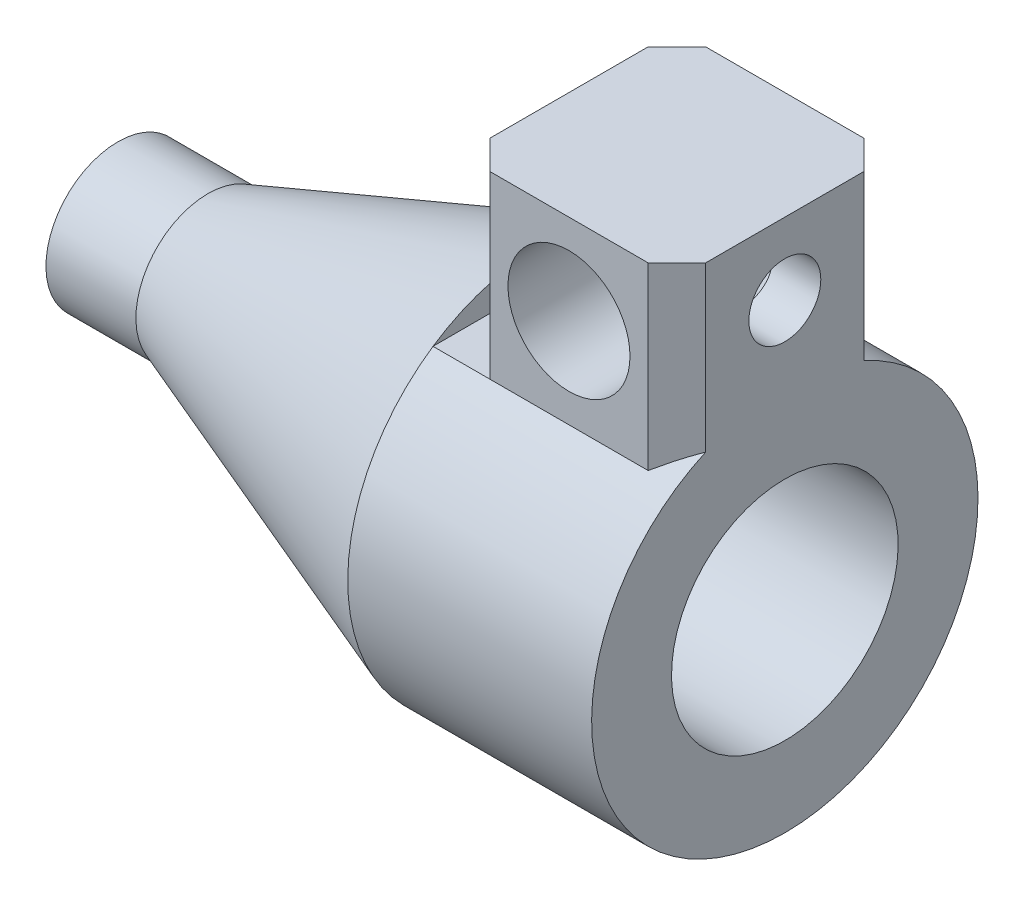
ISO-10303-21;
HEADER;
FILE_DESCRIPTION(('STEP AP214'),'2;1');
FILE_NAME('part.step','',(''),(''),'','','');
FILE_SCHEMA(('AUTOMOTIVE_DESIGN { 1 0 10303 214 1 1 1 1 }'));
ENDSEC;
DATA;
#1=APPLICATION_CONTEXT('core data for automotive mechanical design processes');
#2=APPLICATION_PROTOCOL_DEFINITION('international standard','automotive_design',2000,#1);
#3=PRODUCT_CONTEXT('',#1,'mechanical');
#4=PRODUCT('Part','Part','',(#3));
#5=PRODUCT_RELATED_PRODUCT_CATEGORY('part','',(#4));
#6=PRODUCT_DEFINITION_FORMATION('','',#4);
#7=PRODUCT_DEFINITION_CONTEXT('part definition',#1,'design');
#8=PRODUCT_DEFINITION('design','',#6,#7);
#9=PRODUCT_DEFINITION_SHAPE('','',#8);
#10=(LENGTH_UNIT() NAMED_UNIT(*) SI_UNIT(.MILLI.,.METRE.));
#11=(NAMED_UNIT(*) PLANE_ANGLE_UNIT() SI_UNIT($,.RADIAN.));
#12=(NAMED_UNIT(*) SI_UNIT($,.STERADIAN.) SOLID_ANGLE_UNIT());
#13=UNCERTAINTY_MEASURE_WITH_UNIT(LENGTH_MEASURE(1.E-05),#10,'distance_accuracy_value','');
#14=(GEOMETRIC_REPRESENTATION_CONTEXT(3) GLOBAL_UNCERTAINTY_ASSIGNED_CONTEXT((#13)) GLOBAL_UNIT_ASSIGNED_CONTEXT((#10,
#11,#12)) REPRESENTATION_CONTEXT('',''));
#15=CARTESIAN_POINT('',(0.,0.,0.));
#16=DIRECTION('',(0.,0.,1.));
#17=DIRECTION('',(1.,0.,0.));
#18=AXIS2_PLACEMENT_3D('',#15,#16,#17);
#19=CARTESIAN_POINT('',(0.,47.3320331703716,0.));
#20=DIRECTION('',(1.,0.,0.));
#21=DIRECTION('',(0.,0.,-1.));
#22=AXIS2_PLACEMENT_3D('',#19,#20,#21);
#23=CYLINDRICAL_SURFACE('',#22,6.34999999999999);
#24=CARTESIAN_POINT('',(-29.3409503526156,47.3320331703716,-6.34999999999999));
#25=CARTESIAN_POINT('',(-29.2853842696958,47.5121327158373,-6.3499990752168));
#26=CARTESIAN_POINT('',(-29.2250766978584,47.6907824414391,-6.34232780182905));
#27=CARTESIAN_POINT('',(-29.095604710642,48.0436059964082,-6.31248988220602));
#28=CARTESIAN_POINT('',(-29.0264385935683,48.2177789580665,-6.29032044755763));
#29=CARTESIAN_POINT('',(-28.8799823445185,48.5604959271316,-6.23246367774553));
#30=CARTESIAN_POINT('',(-28.8026864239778,48.7290358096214,-6.19676666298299));
#31=CARTESIAN_POINT('',(-28.6408465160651,49.0594629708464,-6.11290116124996));
#32=CARTESIAN_POINT('',(-28.5562993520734,49.2213472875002,-6.06472718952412));
#33=CARTESIAN_POINT('',(-28.3816576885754,49.53630626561,-5.95744174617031));
#34=CARTESIAN_POINT('',(-28.2916188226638,49.6894461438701,-5.89843070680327));
#35=CARTESIAN_POINT('',(-28.1061985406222,49.9880270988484,-5.77014895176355));
#36=CARTESIAN_POINT('',(-28.0108149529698,50.1334649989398,-5.7008740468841));
#37=CARTESIAN_POINT('',(-27.7179886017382,50.5576636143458,-5.47901586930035));
#38=CARTESIAN_POINT('',(-27.5137285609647,50.8245609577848,-5.31231092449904));
#39=CARTESIAN_POINT('',(-27.1792549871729,51.2236715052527,-5.02111982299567));
#40=CARTESIAN_POINT('',(-27.0525581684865,51.3666523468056,-4.90688066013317));
#41=CARTESIAN_POINT('',(-26.7965487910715,51.6410441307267,-4.66776482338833));
#42=CARTESIAN_POINT('',(-26.667235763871,51.7724529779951,-4.54288623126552));
#43=CARTESIAN_POINT('',(-26.4074372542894,52.0237419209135,-4.28288444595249));
#44=CARTESIAN_POINT('',(-26.276950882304,52.1436122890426,-4.147752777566));
#45=CARTESIAN_POINT('',(-26.0166185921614,52.3716800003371,-3.86744199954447));
#46=CARTESIAN_POINT('',(-25.8867725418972,52.479879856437,-3.72226506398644));
#47=CARTESIAN_POINT('',(-25.6586875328,52.6614884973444,-3.45532620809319));
#48=CARTESIAN_POINT('',(-25.5599001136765,52.7372529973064,-3.33562935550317));
#49=CARTESIAN_POINT('',(-25.3652199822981,52.8815361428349,-3.08963705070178));
#50=CARTESIAN_POINT('',(-25.2693276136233,52.9500539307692,-2.96334082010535));
#51=CARTESIAN_POINT('',(-25.0822219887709,53.0794483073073,-2.70383368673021));
#52=CARTESIAN_POINT('',(-24.9910025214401,53.140335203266,-2.5706324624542));
#53=CARTESIAN_POINT('',(-24.815381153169,53.2540441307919,-2.29657999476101));
#54=CARTESIAN_POINT('',(-24.7309758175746,53.3068702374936,-2.15573266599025));
#55=CARTESIAN_POINT('',(-24.553621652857,53.4148671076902,-1.83222681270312));
#56=CARTESIAN_POINT('',(-24.4631687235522,53.4677856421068,-1.6473993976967));
#57=CARTESIAN_POINT('',(-24.3050893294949,53.5579189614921,-1.26462742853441));
#58=CARTESIAN_POINT('',(-24.2374145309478,53.5951670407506,-1.06671172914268));
#59=CARTESIAN_POINT('',(-24.1438419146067,53.6459431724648,-0.696627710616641));
#60=CARTESIAN_POINT('',(-24.1126023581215,53.6625426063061,-0.526275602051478));
#61=CARTESIAN_POINT('',(-24.0763748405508,53.6817543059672,-0.182069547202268));
#62=CARTESIAN_POINT('',(-24.0713571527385,53.6843824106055,-0.00821979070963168));
#63=CARTESIAN_POINT('',(-24.0883351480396,53.6754112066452,0.337626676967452));
#64=CARTESIAN_POINT('',(-24.1103163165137,53.663819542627,0.509624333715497));
#65=CARTESIAN_POINT('',(-24.1779091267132,53.6275279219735,0.847494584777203));
#66=CARTESIAN_POINT('',(-24.2235570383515,53.6028078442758,1.0133573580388));
#67=CARTESIAN_POINT('',(-24.3636957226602,53.5249697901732,1.42680020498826));
#68=CARTESIAN_POINT('',(-24.4712284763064,53.4637030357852,1.66837356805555));
#69=CARTESIAN_POINT('',(-24.6521562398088,53.3551417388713,2.01480102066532));
#70=CARTESIAN_POINT('',(-24.7158981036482,53.316073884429,2.12785123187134));
#71=CARTESIAN_POINT('',(-24.8484075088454,53.2327623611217,2.34900529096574));
#72=CARTESIAN_POINT('',(-24.9171739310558,53.1885198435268,2.45711023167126));
#73=CARTESIAN_POINT('',(-25.1131895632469,53.0589740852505,2.75079956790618));
#74=CARTESIAN_POINT('',(-25.2444175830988,52.9684462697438,2.93142040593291));
#75=CARTESIAN_POINT('',(-25.5133415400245,52.7731348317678,3.27975232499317));
#76=CARTESIAN_POINT('',(-25.6510420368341,52.6683410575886,3.44745407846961));
#77=CARTESIAN_POINT('',(-25.9295563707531,52.4448503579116,3.77097962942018));
#78=CARTESIAN_POINT('',(-26.0703737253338,52.326136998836,3.92678902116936));
#79=CARTESIAN_POINT('',(-26.3523391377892,52.0750991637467,4.2265859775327));
#80=CARTESIAN_POINT('',(-26.4934871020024,51.9427781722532,4.3705765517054));
#81=CARTESIAN_POINT('',(-26.7812785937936,51.6573512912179,4.65366173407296));
#82=CARTESIAN_POINT('',(-26.9278323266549,51.5035271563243,4.79212567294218));
#83=CARTESIAN_POINT('',(-27.2169316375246,51.1807405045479,5.05502471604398));
#84=CARTESIAN_POINT('',(-27.3594764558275,51.0117751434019,5.17945717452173));
#85=CARTESIAN_POINT('',(-27.6381621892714,50.6591974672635,5.41267503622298));
#86=CARTESIAN_POINT('',(-27.7743167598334,50.4756188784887,5.52149493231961));
#87=CARTESIAN_POINT('',(-28.0384593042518,50.0938422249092,5.72200597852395));
#88=CARTESIAN_POINT('',(-28.1664508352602,49.8956506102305,5.81370462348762));
#89=CARTESIAN_POINT('',(-28.377131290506,49.5438835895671,5.95442464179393));
#90=CARTESIAN_POINT('',(-28.4623372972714,49.393685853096,6.00816149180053));
#91=CARTESIAN_POINT('',(-28.626698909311,49.0866797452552,6.10488354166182));
#92=CARTESIAN_POINT('',(-28.7058560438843,48.9298730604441,6.14787146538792));
#93=CARTESIAN_POINT('',(-28.8573215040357,48.6103439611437,6.22216318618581));
#94=CARTESIAN_POINT('',(-28.9296320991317,48.4476235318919,6.25347086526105));
#95=CARTESIAN_POINT('',(-29.0666890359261,48.1171119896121,6.30349758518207));
#96=CARTESIAN_POINT('',(-29.1314352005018,47.949320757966,6.32221633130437));
#97=CARTESIAN_POINT('',(-29.2531515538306,47.6085483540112,6.34629258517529));
#98=CARTESIAN_POINT('',(-29.310059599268,47.4355376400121,6.35154854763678));
#99=CARTESIAN_POINT('',(-29.4149802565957,47.0869800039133,6.34766260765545));
#100=CARTESIAN_POINT('',(-29.462992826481,46.9114330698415,6.3385206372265));
#101=CARTESIAN_POINT('',(-29.5497643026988,46.559543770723,6.30531333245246));
#102=CARTESIAN_POINT('',(-29.5885275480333,46.3832018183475,6.28125501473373));
#103=CARTESIAN_POINT('',(-29.6567395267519,46.0314519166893,6.21795067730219));
#104=CARTESIAN_POINT('',(-29.6861892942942,45.8560438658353,6.17870634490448));
#105=CARTESIAN_POINT('',(-29.7330546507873,45.5284285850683,6.09055226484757));
#106=CARTESIAN_POINT('',(-29.7514762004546,45.3759118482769,6.04331462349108));
#107=CARTESIAN_POINT('',(-29.7815374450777,45.0742871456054,5.93722467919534));
#108=CARTESIAN_POINT('',(-29.7931772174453,44.9251791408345,5.87837250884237));
#109=CARTESIAN_POINT('',(-29.8101458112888,44.631559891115,5.74940491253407));
#110=CARTESIAN_POINT('',(-29.8154748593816,44.487048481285,5.67928989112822));
#111=CARTESIAN_POINT('',(-29.8204314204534,44.2036839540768,5.52826479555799));
#112=CARTESIAN_POINT('',(-29.8200587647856,44.0648310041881,5.44735440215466));
#113=CARTESIAN_POINT('',(-29.8143510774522,43.794998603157,5.27609489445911));
#114=CARTESIAN_POINT('',(-29.8090623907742,43.6639577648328,5.18584091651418));
#115=CARTESIAN_POINT('',(-29.7943593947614,43.4091459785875,4.99587243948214));
#116=CARTESIAN_POINT('',(-29.7849437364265,43.2853774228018,4.89615485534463));
#117=CARTESIAN_POINT('',(-29.7517219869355,42.9261048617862,4.58376432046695));
#118=CARTESIAN_POINT('',(-29.7229356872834,42.7024675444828,4.35774764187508));
#119=CARTESIAN_POINT('',(-29.6562346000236,42.2747783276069,3.85542442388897));
#120=CARTESIAN_POINT('',(-29.6177615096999,42.07387896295,3.57650395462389));
#121=CARTESIAN_POINT('',(-29.5607330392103,41.8082099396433,3.13676998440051));
#122=CARTESIAN_POINT('',(-29.5418251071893,41.7255585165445,2.98652935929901));
#123=CARTESIAN_POINT('',(-29.5052054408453,41.5726282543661,2.67975528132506));
#124=CARTESIAN_POINT('',(-29.4874933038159,41.5023452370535,2.52322397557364));
#125=CARTESIAN_POINT('',(-29.4533803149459,41.3715801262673,2.19722546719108));
#126=CARTESIAN_POINT('',(-29.4370817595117,41.3117224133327,2.02749701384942));
#127=CARTESIAN_POINT('',(-29.4077086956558,41.2065863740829,1.68337531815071));
#128=CARTESIAN_POINT('',(-29.3946329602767,41.1613024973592,1.50898387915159));
#129=CARTESIAN_POINT('',(-29.3724353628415,41.0856868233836,1.15676147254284));
#130=CARTESIAN_POINT('',(-29.3633129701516,41.0553530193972,0.978930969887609));
#131=CARTESIAN_POINT('',(-29.349539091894,41.0099161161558,0.62116558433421));
#132=CARTESIAN_POINT('',(-29.3448874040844,40.9948123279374,0.441230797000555));
#133=CARTESIAN_POINT('',(-29.3404009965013,40.980244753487,0.0870537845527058));
#134=CARTESIAN_POINT('',(-29.3404016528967,40.9802464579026,-0.0871645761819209));
#135=CARTESIAN_POINT('',(-29.3448086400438,40.9945570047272,-0.434953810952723));
#136=CARTESIAN_POINT('',(-29.3492148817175,41.0088655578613,-0.608524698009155));
#137=CARTESIAN_POINT('',(-29.3621981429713,41.0516586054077,-0.953757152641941));
#138=CARTESIAN_POINT('',(-29.3707753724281,41.0801438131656,-1.12541862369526));
#139=CARTESIAN_POINT('',(-29.3916463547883,41.1510395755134,-1.46560848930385));
#140=CARTESIAN_POINT('',(-29.4039401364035,41.1934502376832,-1.63413685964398));
#141=CARTESIAN_POINT('',(-29.4314247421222,41.2912267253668,-1.96481842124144));
#142=CARTESIAN_POINT('',(-29.4465770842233,41.3464224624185,-2.12702520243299));
#143=CARTESIAN_POINT('',(-29.4791131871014,41.4696659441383,-2.44631262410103));
#144=CARTESIAN_POINT('',(-29.4964977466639,41.5377182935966,-2.6033914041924));
#145=CARTESIAN_POINT('',(-29.5326101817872,41.6862028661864,-2.91141396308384));
#146=CARTESIAN_POINT('',(-29.5513380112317,41.7666346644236,-3.0623579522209));
#147=CARTESIAN_POINT('',(-29.5891775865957,41.9394125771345,-3.35728513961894));
#148=CARTESIAN_POINT('',(-29.6082894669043,42.0317629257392,-3.50126583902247));
#149=CARTESIAN_POINT('',(-29.6466796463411,42.2320643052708,-3.78742958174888));
#150=CARTESIAN_POINT('',(-29.6659293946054,42.3405173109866,-3.92926556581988));
#151=CARTESIAN_POINT('',(-29.7025203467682,42.5691133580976,-4.20344522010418));
#152=CARTESIAN_POINT('',(-29.7198615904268,42.6892561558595,-4.3357890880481));
#153=CARTESIAN_POINT('',(-29.7514193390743,42.9405061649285,-4.59009186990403));
#154=CARTESIAN_POINT('',(-29.7656352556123,43.0716154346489,-4.71204882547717));
#155=CARTESIAN_POINT('',(-29.7897240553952,43.3438478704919,-4.94458350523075));
#156=CARTESIAN_POINT('',(-29.7995988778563,43.4849665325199,-5.05516629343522));
#157=CARTESIAN_POINT('',(-29.8137424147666,43.7739750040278,-5.26249499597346));
#158=CARTESIAN_POINT('',(-29.8180960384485,43.9217251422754,-5.35942957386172));
#159=CARTESIAN_POINT('',(-29.8204521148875,44.2247700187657,-5.54062849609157));
#160=CARTESIAN_POINT('',(-29.8184575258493,44.3800612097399,-5.62489872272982));
#161=CARTESIAN_POINT('',(-29.8072301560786,44.6968330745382,-5.78007863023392));
#162=CARTESIAN_POINT('',(-29.798001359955,44.8583102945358,-5.85099563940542));
#163=CARTESIAN_POINT('',(-29.7715884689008,45.1860303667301,-5.97897201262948));
#164=CARTESIAN_POINT('',(-29.7544051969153,45.352272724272,-6.0360328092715));
#165=CARTESIAN_POINT('',(-29.7139697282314,45.6691985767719,-6.13039143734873));
#166=CARTESIAN_POINT('',(-29.6916062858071,45.8195534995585,-6.16918233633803));
#167=CARTESIAN_POINT('',(-29.6400023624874,46.1216233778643,-6.23548908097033));
#168=CARTESIAN_POINT('',(-29.6107594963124,46.2733387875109,-6.2630010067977));
#169=CARTESIAN_POINT('',(-29.5453604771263,46.5769096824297,-6.30680665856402));
#170=CARTESIAN_POINT('',(-29.5092036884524,46.7287651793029,-6.32309935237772));
#171=CARTESIAN_POINT('',(-29.4301068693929,47.0314256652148,-6.34469481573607));
#172=CARTESIAN_POINT('',(-29.3871688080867,47.182230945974,-6.35000076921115));
#173=CARTESIAN_POINT('',(-29.3409503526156,47.3320331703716,-6.34999999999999));
#174=B_SPLINE_CURVE_WITH_KNOTS('',3,(#24,#25,#26,#27,#28,#29,#30,#31,#32,#33,#34,#35,#36,#37,
#38,#39,#40,#41,#42,#43,#44,#45,#46,#47,#48,#49,#50,#51,#52,#53,#54,#55,#56,#57,#58,#59,#60,#61,
#62,#63,#64,#65,#66,#67,#68,#69,#70,#71,#72,#73,#74,#75,#76,#77,#78,#79,#80,#81,#82,#83,#84,#85,
#86,#87,#88,#89,#90,#91,#92,#93,#94,#95,#96,#97,#98,#99,#100,#101,#102,#103,#104,#105,#106,#107,
#108,#109,#110,#111,#112,#113,#114,#115,#116,#117,#118,#119,#120,#121,#122,#123,#124,#125,#126,
#127,#128,#129,#130,#131,#132,#133,#134,#135,#136,#137,#138,#139,#140,#141,#142,#143,#144,#145,
#146,#147,#148,#149,#150,#151,#152,#153,#154,#155,#156,#157,#158,#159,#160,#161,#162,#163,#164,
#165,#166,#167,#168,#169,#170,#171,#172,#173),.UNSPECIFIED.,.T.,.F.,(4,2,2,2,2,2,2,2,2,2,2,2,2,
2,2,2,2,2,2,2,2,2,2,2,2,2,2,2,2,2,2,2,2,2,2,2,2,2,2,2,2,2,2,2,2,2,2,2,2,2,2,2,2,2,2,2,2,2,2,2,2,
2,2,2,2,2,2,2,2,2,2,2,2,2,4),(0.,0.565249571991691,1.13060788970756,1.69637151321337,
2.26238426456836,2.82339441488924,3.3846341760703,4.50621571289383,5.17353468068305,
5.84097421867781,6.50897160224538,7.17682486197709,7.69466859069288,8.2125735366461,
8.72977121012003,9.24670654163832,9.88246632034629,10.516868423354,11.0365465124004,
11.5556353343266,12.0744452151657,12.5940525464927,13.4034059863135,13.8098657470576,
14.2162352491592,14.93789983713,15.6600806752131,16.383122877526,17.1059803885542,
17.8659413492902,18.6260453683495,19.3844433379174,20.1425085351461,20.6845786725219,
21.226511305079,21.7682636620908,22.3100287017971,22.8558682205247,23.4017103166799,
23.9472958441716,24.4928207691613,24.9744024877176,25.4559787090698,25.9375376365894,
26.419110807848,26.8961895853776,27.3734244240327,28.3273086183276,29.3601346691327,
29.8772148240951,30.394119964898,30.935586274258,31.4768461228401,32.0180332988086,
32.5591959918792,33.0812096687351,33.6032127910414,34.1252421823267,34.6472756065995,
35.1627269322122,35.6783632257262,36.1939818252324,36.7097841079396,37.2478943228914,
37.7859933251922,38.3241935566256,38.8621531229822,39.3917350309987,39.9210701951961,
40.4501140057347,40.9791030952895,41.4491931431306,41.9194464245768,42.3897429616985,
42.8599031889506),.UNSPECIFIED.);
#175=CARTESIAN_POINT('',(-29.3409503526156,47.3320331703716,-6.34999999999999));
#176=VERTEX_POINT('',#175);
#177=EDGE_CURVE('E37',#176,#176,#174,.T.);
#178=ORIENTED_EDGE('',*,*,#177,.T.);
#179=EDGE_LOOP('',(#178));
#180=FACE_BOUND('',#179,.T.);
#181=CARTESIAN_POINT('',(-38.1,47.3320331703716,0.));
#182=DIRECTION('',(1.,0.,0.));
#183=DIRECTION('',(0.,1.,0.));
#184=AXIS2_PLACEMENT_3D('',#181,#182,#183);
#185=CIRCLE('',#184,6.34999999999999);
#186=CARTESIAN_POINT('',(-38.1,53.6820331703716,0.));
#187=VERTEX_POINT('',#186);
#188=EDGE_CURVE('E234',#187,#187,#185,.T.);
#189=ORIENTED_EDGE('',*,*,#188,.F.);
#190=EDGE_LOOP('',(#189));
#191=FACE_BOUND('',#190,.T.);
#192=ADVANCED_FACE('F33',(#180,#191),#23,.F.);
#193=CARTESIAN_POINT('',(-43.053,28.2820331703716,-45.7130065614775));
#194=DIRECTION('',(0.,-1.,0.));
#195=DIRECTION('',(0.,0.,-1.));
#196=AXIS2_PLACEMENT_3D('',#193,#194,#195);
#197=PLANE('',#196);
#198=DIRECTION('',(1.,0.,0.));
#199=VECTOR('',#198,1.);
#200=CARTESIAN_POINT('',(-43.053,28.2820331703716,19.05));
#201=LINE('',#200,#199);
#202=CARTESIAN_POINT('',(-43.0496232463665,28.2820331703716,19.05));
#203=VERTEX_POINT('',#202);
#204=CARTESIAN_POINT('',(-33.02,28.2820331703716,19.05));
#205=VERTEX_POINT('',#204);
#206=EDGE_CURVE('E249',#203,#205,#201,.T.);
#207=ORIENTED_EDGE('',*,*,#206,.T.);
#208=DIRECTION('',(-0.707106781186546,0.,-0.707106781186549));
#209=VECTOR('',#208,1.);
#210=CARTESIAN_POINT('',(-70.4180032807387,28.2820331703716,-18.3480032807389));
#211=LINE('',#210,#209);
#212=CARTESIAN_POINT('',(-38.1,28.2820331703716,13.97));
#213=VERTEX_POINT('',#212);
#214=EDGE_CURVE('E181',#205,#213,#211,.T.);
#215=ORIENTED_EDGE('',*,*,#214,.T.);
#216=DIRECTION('',(0.,0.,-1.));
#217=VECTOR('',#216,1.);
#218=CARTESIAN_POINT('',(-38.1,28.2820331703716,19.05));
#219=LINE('',#218,#217);
#220=CARTESIAN_POINT('',(-38.1,28.2820331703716,-13.97));
#221=VERTEX_POINT('',#220);
#222=EDGE_CURVE('E237',#213,#221,#219,.T.);
#223=ORIENTED_EDGE('',*,*,#222,.T.);
#224=DIRECTION('',(0.707106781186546,0.,-0.707106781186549));
#225=VECTOR('',#224,1.);
#226=CARTESIAN_POINT('',(-24.7049967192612,28.2820331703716,-27.3650032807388));
#227=LINE('',#226,#225);
#228=CARTESIAN_POINT('',(-33.02,28.2820331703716,-19.05));
#229=VERTEX_POINT('',#228);
#230=EDGE_CURVE('E183',#221,#229,#227,.T.);
#231=ORIENTED_EDGE('',*,*,#230,.T.);
#232=DIRECTION('',(1.,0.,0.));
#233=VECTOR('',#232,1.);
#234=CARTESIAN_POINT('',(-43.053,28.2820331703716,-19.05));
#235=LINE('',#234,#233);
#236=CARTESIAN_POINT('',(-43.0496232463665,28.2820331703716,-19.05));
#237=VERTEX_POINT('',#236);
#238=EDGE_CURVE('E55',#237,#229,#235,.T.);
#239=ORIENTED_EDGE('',*,*,#238,.F.);
#240=CARTESIAN_POINT('',(-20.1894231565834,28.2820331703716,-31.6160918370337));
#241=CARTESIAN_POINT('',(-21.2226741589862,28.2820331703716,-31.1114470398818));
#242=CARTESIAN_POINT('',(-22.2538684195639,28.2820331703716,-30.6025537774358));
#243=CARTESIAN_POINT('',(-24.3113725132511,28.2820331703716,-29.5748289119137));
#244=CARTESIAN_POINT('',(-25.3376820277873,28.2820331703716,-29.0559966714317));
#245=CARTESIAN_POINT('',(-27.3868790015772,28.2820331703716,-28.00580421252));
#246=CARTESIAN_POINT('',(-28.4097530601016,28.2820331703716,-27.4744177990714));
#247=CARTESIAN_POINT('',(-30.4485282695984,28.2820331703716,-26.3984682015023));
#248=CARTESIAN_POINT('',(-31.4644295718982,28.2820331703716,-25.8539053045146));
#249=CARTESIAN_POINT('',(-33.5431040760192,28.2820331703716,-24.7191825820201));
#250=CARTESIAN_POINT('',(-34.6054059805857,28.2820331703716,-24.1281570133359));
#251=CARTESIAN_POINT('',(-36.7183332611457,28.2820331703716,-22.9256259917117));
#252=CARTESIAN_POINT('',(-37.7689590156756,28.2820331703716,-22.314121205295));
#253=CARTESIAN_POINT('',(-39.8543333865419,28.2820331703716,-21.066915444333));
#254=CARTESIAN_POINT('',(-40.8890976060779,28.2820331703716,-20.4312407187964));
#255=CARTESIAN_POINT('',(-42.4266098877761,28.2820331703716,-19.4548038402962));
#256=CARTESIAN_POINT('',(-42.9366549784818,28.2820331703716,-19.1255176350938));
#257=CARTESIAN_POINT('',(-43.9510902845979,28.2820331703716,-18.4583551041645));
#258=CARTESIAN_POINT('',(-44.4554806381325,28.2820331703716,-18.1204789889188));
#259=CARTESIAN_POINT('',(-45.4518474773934,28.2820331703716,-17.4390428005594));
#260=CARTESIAN_POINT('',(-45.9439000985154,28.2820331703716,-17.0955942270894));
#261=CARTESIAN_POINT('',(-46.9204059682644,28.2820331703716,-16.3980277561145));
#262=CARTESIAN_POINT('',(-47.404859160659,28.2820331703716,-16.0439097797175));
#263=CARTESIAN_POINT('',(-48.3652438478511,28.2820331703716,-15.3231409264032));
#264=CARTESIAN_POINT('',(-48.8411649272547,28.2820331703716,-14.956476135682));
#265=CARTESIAN_POINT('',(-49.7819984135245,28.2820331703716,-14.2092726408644));
#266=CARTESIAN_POINT('',(-50.2469112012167,28.2820331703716,-13.8287344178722));
#267=CARTESIAN_POINT('',(-51.1576377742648,28.2820331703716,-13.0564579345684));
#268=CARTESIAN_POINT('',(-51.6036157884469,28.2820331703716,-12.6649140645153));
#269=CARTESIAN_POINT('',(-52.4793060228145,28.2820331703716,-11.8637973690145));
#270=CARTESIAN_POINT('',(-52.9090153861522,28.2820331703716,-11.4542214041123));
#271=CARTESIAN_POINT('',(-53.7469376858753,28.2820331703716,-10.615144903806));
#272=CARTESIAN_POINT('',(-54.1551912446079,28.2820331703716,-10.1856851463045));
#273=CARTESIAN_POINT('',(-54.9450962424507,28.2820331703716,-9.30310416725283));
#274=CARTESIAN_POINT('',(-55.3267616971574,28.2820331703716,-8.84999563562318));
#275=CARTESIAN_POINT('',(-55.9342221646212,28.2820331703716,-8.07199726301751));
#276=CARTESIAN_POINT('',(-56.1696235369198,28.2820331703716,-7.75461296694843));
#277=CARTESIAN_POINT('',(-56.6219220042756,28.2820331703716,-7.10677956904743));
#278=CARTESIAN_POINT('',(-56.8388170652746,28.2820331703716,-6.77632903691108));
#279=CARTESIAN_POINT('',(-57.2500710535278,28.2820331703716,-6.10204621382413));
#280=CARTESIAN_POINT('',(-57.4444516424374,28.2820331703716,-5.75822721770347));
#281=CARTESIAN_POINT('',(-57.8064000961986,28.2820331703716,-5.05670948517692));
#282=CARTESIAN_POINT('',(-57.9739745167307,28.2820331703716,-4.69901416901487));
#283=CARTESIAN_POINT('',(-58.2468788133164,28.2820331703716,-4.04336244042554));
#284=CARTESIAN_POINT('',(-58.3579526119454,28.2820331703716,-3.7478006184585));
#285=CARTESIAN_POINT('',(-58.5570556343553,28.2820331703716,-3.14903966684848));
#286=CARTESIAN_POINT('',(-58.6450914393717,28.2820331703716,-2.84584274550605));
#287=CARTESIAN_POINT('',(-58.7955840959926,28.2820331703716,-2.23335196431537));
#288=CARTESIAN_POINT('',(-58.8580596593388,28.2820331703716,-1.92406273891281));
#289=CARTESIAN_POINT('',(-58.9554829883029,28.2820331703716,-1.30114404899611));
#290=CARTESIAN_POINT('',(-58.9904311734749,28.2820331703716,-0.987514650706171));
#291=CARTESIAN_POINT('',(-59.0316531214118,28.2820331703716,-0.356738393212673));
#292=CARTESIAN_POINT('',(-59.0377786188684,28.2820331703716,-0.0395817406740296));
#293=CARTESIAN_POINT('',(-59.0207223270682,28.2820331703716,0.593928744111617));
#294=CARTESIAN_POINT('',(-58.9975409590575,28.2820331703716,0.910282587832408));
#295=CARTESIAN_POINT('',(-58.9227154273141,28.2820331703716,1.53968950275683));
#296=CARTESIAN_POINT('',(-58.8710613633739,28.2820331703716,1.85274138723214));
#297=CARTESIAN_POINT('',(-58.7410676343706,28.2820331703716,2.47323425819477));
#298=CARTESIAN_POINT('',(-58.6627242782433,28.2820331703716,2.78067446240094));
#299=CARTESIAN_POINT('',(-58.4582563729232,28.2820331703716,3.46707370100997));
#300=CARTESIAN_POINT('',(-58.3250101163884,28.2820331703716,3.84391157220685));
#301=CARTESIAN_POINT('',(-58.025294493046,28.2820331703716,4.58417719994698));
#302=CARTESIAN_POINT('',(-57.8588075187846,28.2820331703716,4.94759772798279));
#303=CARTESIAN_POINT('',(-57.4975551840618,28.2820331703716,5.66094562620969));
#304=CARTESIAN_POINT('',(-57.3027308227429,28.2820331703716,6.01084286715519));
#305=CARTESIAN_POINT('',(-56.8898099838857,28.2820331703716,6.69651026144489));
#306=CARTESIAN_POINT('',(-56.6717137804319,28.2820331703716,7.03228058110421));
#307=CARTESIAN_POINT('',(-56.2281483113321,28.2820331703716,7.67321121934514));
#308=CARTESIAN_POINT('',(-56.003659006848,28.2820331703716,7.97905433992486));
#309=CARTESIAN_POINT('',(-55.5401359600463,28.2820331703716,8.57954990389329));
#310=CARTESIAN_POINT('',(-55.3010996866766,28.2820331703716,8.87420038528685));
#311=CARTESIAN_POINT('',(-54.8106381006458,28.2820331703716,9.45334851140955));
#312=CARTESIAN_POINT('',(-54.559203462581,28.2820331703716,9.73783822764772));
#313=CARTESIAN_POINT('',(-54.0459755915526,28.2820331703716,10.2973236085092));
#314=CARTESIAN_POINT('',(-53.7841815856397,28.2820331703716,10.5723185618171));
#315=CARTESIAN_POINT('',(-53.2495760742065,28.2820331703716,11.1158696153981));
#316=CARTESIAN_POINT('',(-52.9766911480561,28.2820331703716,11.3843533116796));
#317=CARTESIAN_POINT('',(-52.4232483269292,28.2820331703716,11.9132781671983));
#318=CARTESIAN_POINT('',(-52.1426903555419,28.2820331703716,12.1737192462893));
#319=CARTESIAN_POINT('',(-51.5751291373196,28.2820331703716,12.6871165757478));
#320=CARTESIAN_POINT('',(-51.2881299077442,28.2820331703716,12.9400772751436));
#321=CARTESIAN_POINT('',(-50.7083929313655,28.2820331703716,13.4393098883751));
#322=CARTESIAN_POINT('',(-50.4156552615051,28.2820331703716,13.6855818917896));
#323=CARTESIAN_POINT('',(-49.5380298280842,28.2820331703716,14.4085850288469));
#324=CARTESIAN_POINT('',(-48.9458849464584,28.2820331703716,14.876524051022));
#325=CARTESIAN_POINT('',(-47.7463403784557,28.2820331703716,15.7924938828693));
#326=CARTESIAN_POINT('',(-47.1389381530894,28.2820331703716,16.2405213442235));
#327=CARTESIAN_POINT('',(-45.9116184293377,28.2820331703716,17.1198559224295));
#328=CARTESIAN_POINT('',(-45.2916935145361,28.2820331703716,17.5511526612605));
#329=CARTESIAN_POINT('',(-44.042001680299,28.2820331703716,18.3991227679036));
#330=CARTESIAN_POINT('',(-43.4122353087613,28.2820331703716,18.8157969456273));
#331=CARTESIAN_POINT('',(-42.1423515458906,28.2820331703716,19.6379262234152));
#332=CARTESIAN_POINT('',(-41.5022059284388,28.2820331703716,20.0433376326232));
#333=CARTESIAN_POINT('',(-40.2150248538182,28.2820331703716,20.84306752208));
#334=CARTESIAN_POINT('',(-39.5679893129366,28.2820331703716,21.2373858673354));
#335=CARTESIAN_POINT('',(-38.2683021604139,28.2820331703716,22.0161425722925));
#336=CARTESIAN_POINT('',(-37.6156525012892,28.2820331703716,22.4005841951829));
#337=CARTESIAN_POINT('',(-36.3053469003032,28.2820331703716,23.1608470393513));
#338=CARTESIAN_POINT('',(-35.6476908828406,28.2820331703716,23.5366681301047));
#339=CARTESIAN_POINT('',(-33.7718782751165,28.2820331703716,24.5942286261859));
#340=CARTESIAN_POINT('',(-32.548548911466,28.2820331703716,25.2668002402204));
#341=CARTESIAN_POINT('',(-30.0903720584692,28.2820331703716,26.5907506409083));
#342=CARTESIAN_POINT('',(-28.8555234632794,28.2820331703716,27.2421273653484));
#343=CARTESIAN_POINT('',(-26.3861500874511,28.2820331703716,28.5222799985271));
#344=CARTESIAN_POINT('',(-25.151695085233,28.2820331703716,29.1511906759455));
#345=CARTESIAN_POINT('',(-23.2946038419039,28.2820331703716,30.0834641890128));
#346=CARTESIAN_POINT('',(-22.6747281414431,28.2820331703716,30.3923459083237));
#347=CARTESIAN_POINT('',(-21.4332975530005,28.2820331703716,31.0067037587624));
#348=CARTESIAN_POINT('',(-20.8117426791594,28.2820331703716,31.312179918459));
#349=CARTESIAN_POINT('',(-20.1894231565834,28.2820331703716,31.6160918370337));
#350=B_SPLINE_CURVE_WITH_KNOTS('',3,(#240,#241,#242,#243,#244,#245,#246,#247,#248,#249,#250,
#251,#252,#253,#254,#255,#256,#257,#258,#259,#260,#261,#262,#263,#264,#265,#266,#267,#268,#269,
#270,#271,#272,#273,#274,#275,#276,#277,#278,#279,#280,#281,#282,#283,#284,#285,#286,#287,#288,
#289,#290,#291,#292,#293,#294,#295,#296,#297,#298,#299,#300,#301,#302,#303,#304,#305,#306,#307,
#308,#309,#310,#311,#312,#313,#314,#315,#316,#317,#318,#319,#320,#321,#322,#323,#324,#325,#326,
#327,#328,#329,#330,#331,#332,#333,#334,#335,#336,#337,#338,#339,#340,#341,#342,#343,#344,#345,
#346,#347,#348,#349),.UNSPECIFIED.,.F.,.F.,(4,2,2,2,2,2,2,2,2,2,2,2,2,2,2,2,2,2,2,2,2,2,2,2,2,2,
2,2,2,2,2,2,2,2,2,2,2,2,2,2,2,2,2,2,2,2,2,2,2,2,2,2,2,2,4),(0.,3.44971978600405,
6.89966155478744,10.3575808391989,13.8154248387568,17.4621717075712,21.108800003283,
24.7515751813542,26.5728179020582,28.394016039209,30.1940746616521,31.9941465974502,
33.7962838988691,35.5983587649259,37.3783507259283,39.1586538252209,40.9354549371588,
42.7113122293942,43.8962430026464,45.0813038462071,46.2652148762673,47.4488359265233,
48.3952428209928,49.3413790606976,50.2868214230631,51.2322493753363,52.1825353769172,
53.1328077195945,54.0834106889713,55.0341451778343,56.2313488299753,57.4291883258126,
58.6295585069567,59.8299145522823,60.9675797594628,62.1054434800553,63.2441765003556,
64.3829946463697,65.5312667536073,66.6795502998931,67.8271365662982,68.974707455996,
71.2382925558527,73.5022568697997,75.7676037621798,78.0328249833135,80.3058653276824,
82.5789333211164,84.8512403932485,87.1235818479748,91.3113687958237,95.4995619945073,
99.655717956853,101.733421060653,103.811106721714),.UNSPECIFIED.);
#351=CARTESIAN_POINT('',(-43.053,28.2820331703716,-19.0477999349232));
#352=VERTEX_POINT('',#351);
#353=EDGE_CURVE('E125',#237,#352,#350,.T.);
#354=ORIENTED_EDGE('',*,*,#353,.T.);
#355=DIRECTION('',(0.,0.,-1.));
#356=VECTOR('',#355,1.);
#357=CARTESIAN_POINT('',(-43.053,28.2820331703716,-45.7130065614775));
#358=LINE('',#357,#356);
#359=CARTESIAN_POINT('',(-43.053,28.2820331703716,19.0477999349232));
#360=VERTEX_POINT('',#359);
#361=EDGE_CURVE('E113',#360,#352,#358,.T.);
#362=ORIENTED_EDGE('',*,*,#361,.F.);
#363=EDGE_CURVE('E118',#360,#203,#350,.T.);
#364=ORIENTED_EDGE('',*,*,#363,.T.);
#365=EDGE_LOOP('',(#207,#215,#223,#231,#239,#354,#362,#364));
#366=FACE_BOUND('',#365,.T.);
#367=ADVANCED_FACE('F123',(#366),#197,.F.);
#368=CARTESIAN_POINT('',(101.6,0.,0.));
#369=DIRECTION('',(1.,0.,0.));
#370=DIRECTION('',(0.,1.,0.));
#371=AXIS2_PLACEMENT_3D('',#368,#369,#370);
#372=CYLINDRICAL_SURFACE('',#371,12.7);
#373=CARTESIAN_POINT('',(-117.719266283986,0.,0.));
#374=DIRECTION('',(1.,0.,0.));
#375=DIRECTION('',(0.,1.,0.));
#376=AXIS2_PLACEMENT_3D('',#373,#374,#375);
#377=CIRCLE('',#376,12.7);
#378=CARTESIAN_POINT('',(-117.719266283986,12.7,0.));
#379=VERTEX_POINT('',#378);
#380=EDGE_CURVE('E119',#379,#379,#377,.T.);
#381=ORIENTED_EDGE('',*,*,#380,.T.);
#382=EDGE_LOOP('',(#381));
#383=FACE_BOUND('',#382,.T.);
#384=CARTESIAN_POINT('',(-101.844266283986,0.,0.));
#385=DIRECTION('',(1.,0.,0.));
#386=DIRECTION('',(0.,1.,0.));
#387=AXIS2_PLACEMENT_3D('',#384,#385,#386);
#388=CIRCLE('',#387,12.7);
#389=CARTESIAN_POINT('',(-101.844266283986,12.7,0.));
#390=VERTEX_POINT('',#389);
#391=EDGE_CURVE('E251',#390,#390,#388,.T.);
#392=ORIENTED_EDGE('',*,*,#391,.F.);
#393=EDGE_LOOP('',(#392));
#394=FACE_BOUND('',#393,.T.);
#395=ADVANCED_FACE('F147',(#383,#394),#372,.T.);
#396=CARTESIAN_POINT('',(-117.719266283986,-171.265149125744,0.));
#397=DIRECTION('',(-1.,0.,0.));
#398=DIRECTION('',(0.,-1.,0.));
#399=AXIS2_PLACEMENT_3D('',#396,#397,#398);
#400=PLANE('',#399);
#401=CARTESIAN_POINT('',(-117.719266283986,0.,0.));
#402=DIRECTION('',(1.,0.,0.));
#403=DIRECTION('',(0.,1.,0.));
#404=AXIS2_PLACEMENT_3D('',#401,#402,#403);
#405=CIRCLE('',#404,1.49999999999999);
#406=CARTESIAN_POINT('',(-117.719266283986,1.49999999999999,0.));
#407=VERTEX_POINT('',#406);
#408=EDGE_CURVE('E272',#407,#407,#405,.T.);
#409=ORIENTED_EDGE('',*,*,#408,.T.);
#410=EDGE_LOOP('',(#409));
#411=FACE_BOUND('',#410,.T.);
#412=ORIENTED_EDGE('',*,*,#380,.F.);
#413=EDGE_LOOP('',(#412));
#414=FACE_BOUND('',#413,.T.);
#415=ADVANCED_FACE('F279',(#411,#414),#400,.T.);
#416=CARTESIAN_POINT('',(101.6,0.,0.));
#417=DIRECTION('',(1.,0.,0.));
#418=DIRECTION('',(0.,1.,0.));
#419=AXIS2_PLACEMENT_3D('',#416,#417,#418);
#420=CYLINDRICAL_SURFACE('',#419,1.5);
#421=ORIENTED_EDGE('',*,*,#408,.F.);
#422=EDGE_LOOP('',(#421));
#423=FACE_BOUND('',#422,.T.);
#424=CARTESIAN_POINT('',(-91.1274236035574,0.,0.));
#425=DIRECTION('',(1.,0.,0.));
#426=DIRECTION('',(0.,1.,0.));
#427=AXIS2_PLACEMENT_3D('',#424,#425,#426);
#428=CIRCLE('',#427,1.5);
#429=CARTESIAN_POINT('',(-91.1274236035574,1.50000000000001,0.));
#430=VERTEX_POINT('',#429);
#431=EDGE_CURVE('E269',#430,#430,#428,.T.);
#432=ORIENTED_EDGE('',*,*,#431,.T.);
#433=EDGE_LOOP('',(#432));
#434=FACE_BOUND('',#433,.T.);
#435=ADVANCED_FACE('F281',(#423,#434),#420,.F.);
#436=CARTESIAN_POINT('',(-84.3977846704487,0.,0.));
#437=DIRECTION('',(1.,0.,0.));
#438=DIRECTION('',(0.,1.,0.));
#439=AXIS2_PLACEMENT_3D('',#436,#437,#438);
#440=CONICAL_SURFACE('',#439,12.7,1.02974425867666);
#441=CARTESIAN_POINT('',(-84.3977846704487,0.,0.));
#442=DIRECTION('',(1.,0.,0.));
#443=DIRECTION('',(0.,1.,0.));
#444=AXIS2_PLACEMENT_3D('',#441,#442,#443);
#445=CIRCLE('',#444,12.7);
#446=CARTESIAN_POINT('',(-84.3977846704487,12.7,0.));
#447=VERTEX_POINT('',#446);
#448=EDGE_CURVE('E266',#447,#447,#445,.T.);
#449=CARTESIAN_POINT('',(-91.1274236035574,1.50000000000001,0.));
#450=CARTESIAN_POINT('',(-91.0573231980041,1.61666666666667,0.));
#451=CARTESIAN_POINT('',(-90.9872227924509,1.73333333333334,0.));
#452=CARTESIAN_POINT('',(-90.8470219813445,1.96666666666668,0.));
#453=CARTESIAN_POINT('',(-90.7769215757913,2.08333333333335,0.));
#454=CARTESIAN_POINT('',(-90.6367207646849,2.31666666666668,0.));
#455=CARTESIAN_POINT('',(-90.5666203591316,2.43333333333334,0.));
#456=CARTESIAN_POINT('',(-90.4264195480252,2.66666666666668,0.));
#457=CARTESIAN_POINT('',(-90.356319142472,2.78333333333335,0.));
#458=CARTESIAN_POINT('',(-90.2161183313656,3.01666666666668,0.));
#459=CARTESIAN_POINT('',(-90.1460179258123,3.13333333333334,0.));
#460=CARTESIAN_POINT('',(-90.0058171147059,3.36666666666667,0.));
#461=CARTESIAN_POINT('',(-89.9357167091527,3.48333333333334,0.));
#462=CARTESIAN_POINT('',(-89.7955158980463,3.71666666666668,0.));
#463=CARTESIAN_POINT('',(-89.7254154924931,3.83333333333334,0.));
#464=CARTESIAN_POINT('',(-89.5852146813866,4.06666666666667,0.));
#465=CARTESIAN_POINT('',(-89.5151142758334,4.18333333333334,0.));
#466=CARTESIAN_POINT('',(-89.374913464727,4.41666666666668,0.));
#467=CARTESIAN_POINT('',(-89.3048130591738,4.53333333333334,0.));
#468=CARTESIAN_POINT('',(-89.1646122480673,4.76666666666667,0.));
#469=CARTESIAN_POINT('',(-89.0945118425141,4.88333333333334,0.));
#470=CARTESIAN_POINT('',(-88.9543110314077,5.11666666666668,0.));
#471=CARTESIAN_POINT('',(-88.8842106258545,5.23333333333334,0.));
#472=CARTESIAN_POINT('',(-88.744009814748,5.46666666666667,0.));
#473=CARTESIAN_POINT('',(-88.6739094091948,5.58333333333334,0.));
#474=CARTESIAN_POINT('',(-88.5337085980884,5.81666666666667,0.));
#475=CARTESIAN_POINT('',(-88.4636081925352,5.93333333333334,0.));
#476=CARTESIAN_POINT('',(-88.3234073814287,6.16666666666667,0.));
#477=CARTESIAN_POINT('',(-88.2533069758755,6.28333333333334,0.));
#478=CARTESIAN_POINT('',(-88.1131061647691,6.51666666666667,0.));
#479=CARTESIAN_POINT('',(-88.0430057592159,6.63333333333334,0.));
#480=CARTESIAN_POINT('',(-87.9028049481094,6.86666666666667,0.));
#481=CARTESIAN_POINT('',(-87.8327045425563,6.98333333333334,0.));
#482=CARTESIAN_POINT('',(-87.6925037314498,7.21666666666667,0.));
#483=CARTESIAN_POINT('',(-87.6224033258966,7.33333333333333,0.));
#484=CARTESIAN_POINT('',(-87.4822025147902,7.56666666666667,0.));
#485=CARTESIAN_POINT('',(-87.412102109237,7.68333333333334,0.));
#486=CARTESIAN_POINT('',(-87.2719012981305,7.91666666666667,0.));
#487=CARTESIAN_POINT('',(-87.2018008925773,8.03333333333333,0.));
#488=CARTESIAN_POINT('',(-87.0616000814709,8.26666666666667,0.));
#489=CARTESIAN_POINT('',(-86.9914996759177,8.38333333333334,0.));
#490=CARTESIAN_POINT('',(-86.8512988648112,8.61666666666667,0.));
#491=CARTESIAN_POINT('',(-86.781198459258,8.73333333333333,0.));
#492=CARTESIAN_POINT('',(-86.6409976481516,8.96666666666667,0.));
#493=CARTESIAN_POINT('',(-86.5708972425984,9.08333333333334,0.));
#494=CARTESIAN_POINT('',(-86.430696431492,9.31666666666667,0.));
#495=CARTESIAN_POINT('',(-86.3605960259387,9.43333333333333,0.));
#496=CARTESIAN_POINT('',(-86.2203952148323,9.66666666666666,0.));
#497=CARTESIAN_POINT('',(-86.1502948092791,9.78333333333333,0.));
#498=CARTESIAN_POINT('',(-86.0100939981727,10.0166666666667,0.));
#499=CARTESIAN_POINT('',(-85.9399935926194,10.1333333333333,0.));
#500=CARTESIAN_POINT('',(-85.799792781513,10.3666666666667,0.));
#501=CARTESIAN_POINT('',(-85.7296923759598,10.4833333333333,0.));
#502=CARTESIAN_POINT('',(-85.5894915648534,10.7166666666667,0.));
#503=CARTESIAN_POINT('',(-85.5193911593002,10.8333333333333,0.));
#504=CARTESIAN_POINT('',(-85.3791903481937,11.0666666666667,0.));
#505=CARTESIAN_POINT('',(-85.3090899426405,11.1833333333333,0.));
#506=CARTESIAN_POINT('',(-85.1688891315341,11.4166666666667,0.));
#507=CARTESIAN_POINT('',(-85.0987887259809,11.5333333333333,0.));
#508=CARTESIAN_POINT('',(-84.9585879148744,11.7666666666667,0.));
#509=CARTESIAN_POINT('',(-84.8884875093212,11.8833333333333,0.));
#510=CARTESIAN_POINT('',(-84.7482866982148,12.1166666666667,0.));
#511=CARTESIAN_POINT('',(-84.6781862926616,12.2333333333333,0.));
#512=CARTESIAN_POINT('',(-84.5379854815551,12.4666666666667,0.));
#513=CARTESIAN_POINT('',(-84.4678850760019,12.5833333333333,0.));
#514=CARTESIAN_POINT('',(-84.3977846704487,12.7,0.));
#515=B_SPLINE_CURVE_WITH_KNOTS('',3,(#449,#450,#451,#452,#453,#454,#455,#456,#457,#458,#459,
#460,#461,#462,#463,#464,#465,#466,#467,#468,#469,#470,#471,#472,#473,#474,#475,#476,#477,#478,
#479,#480,#481,#482,#483,#484,#485,#486,#487,#488,#489,#490,#491,#492,#493,#494,#495,#496,#497,
#498,#499,#500,#501,#502,#503,#504,#505,#506,#507,#508,#509,#510,#511,#512,#513,#514),
.UNSPECIFIED.,.F.,.F.,(4,2,2,2,2,2,2,2,2,2,2,2,2,2,2,2,2,2,2,2,2,2,2,2,2,2,2,2,2,2,2,2,4),(0.,
0.408321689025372,0.816643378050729,1.2249650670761,1.63328675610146,2.04160844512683,
2.44993013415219,2.85825182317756,3.26657351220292,3.67489520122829,4.08321689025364,
4.49153857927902,4.89986026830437,5.30818195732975,5.7165036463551,6.12482533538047,
6.53314702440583,6.9414687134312,7.34979040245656,7.75811209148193,8.16643378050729,
8.57475546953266,8.98307715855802,9.39139884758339,9.79972053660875,10.2080422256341,
10.6163639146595,11.0246856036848,11.4330072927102,11.8413289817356,12.2496506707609,
12.6579723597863,13.0662940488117),.UNSPECIFIED.);
#516=EDGE_CURVE('BSEAM288',#430,#447,#515,.T.);
#517=ORIENTED_EDGE('',*,*,#431,.F.);
#518=ORIENTED_EDGE('',*,*,#448,.T.);
#519=ORIENTED_EDGE('',*,*,#516,.T.);
#520=ORIENTED_EDGE('',*,*,#516,.F.);
#521=EDGE_LOOP('',(#517,#519,#518,#520));
#522=FACE_BOUND('',#521,.T.);
#523=ADVANCED_FACE('F288',(#522),#440,.F.);
#524=CARTESIAN_POINT('',(101.6,0.,0.));
#525=DIRECTION('',(1.,0.,0.));
#526=DIRECTION('',(0.,1.,0.));
#527=AXIS2_PLACEMENT_3D('',#524,#525,#526);
#528=CYLINDRICAL_SURFACE('',#527,12.7);
#529=ORIENTED_EDGE('',*,*,#448,.F.);
#530=EDGE_LOOP('',(#529));
#531=FACE_BOUND('',#530,.T.);
#532=CARTESIAN_POINT('',(-46.2977846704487,0.,0.));
#533=DIRECTION('',(1.,0.,0.));
#534=DIRECTION('',(0.,1.,0.));
#535=AXIS2_PLACEMENT_3D('',#532,#533,#534);
#536=CIRCLE('',#535,12.7);
#537=CARTESIAN_POINT('',(-46.2977846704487,12.7,0.));
#538=VERTEX_POINT('',#537);
#539=EDGE_CURVE('E263',#538,#538,#536,.T.);
#540=ORIENTED_EDGE('',*,*,#539,.T.);
#541=EDGE_LOOP('',(#540));
#542=FACE_BOUND('',#541,.T.);
#543=ADVANCED_FACE('F415',(#531,#542),#528,.F.);
#544=CARTESIAN_POINT('',(-41.91,0.,0.));
#545=DIRECTION('',(1.,0.,0.));
#546=DIRECTION('',(0.,1.,0.));
#547=AXIS2_PLACEMENT_3D('',#544,#545,#546);
#548=CONICAL_SURFACE('',#547,20.0025,1.02974425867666);
#549=ORIENTED_EDGE('',*,*,#539,.F.);
#550=EDGE_LOOP('',(#549));
#551=FACE_BOUND('',#550,.T.);
#552=CARTESIAN_POINT('',(-41.91,0.,0.));
#553=DIRECTION('',(1.,0.,0.));
#554=DIRECTION('',(0.,1.,0.));
#555=AXIS2_PLACEMENT_3D('',#552,#553,#554);
#556=CIRCLE('',#555,20.0025);
#557=CARTESIAN_POINT('',(-41.91,20.0025,0.));
#558=VERTEX_POINT('',#557);
#559=EDGE_CURVE('E260',#558,#558,#556,.T.);
#560=ORIENTED_EDGE('',*,*,#559,.T.);
#561=EDGE_LOOP('',(#560));
#562=FACE_BOUND('',#561,.T.);
#563=ADVANCED_FACE('F407',(#551,#562),#548,.F.);
#564=CARTESIAN_POINT('',(101.6,0.,0.));
#565=DIRECTION('',(1.,0.,0.));
#566=DIRECTION('',(0.,1.,0.));
#567=AXIS2_PLACEMENT_3D('',#564,#565,#566);
#568=CYLINDRICAL_SURFACE('',#567,20.0025);
#569=ORIENTED_EDGE('',*,*,#559,.F.);
#570=EDGE_LOOP('',(#569));
#571=FACE_BOUND('',#570,.T.);
#572=CARTESIAN_POINT('',(0.,0.,0.));
#573=DIRECTION('',(1.,0.,0.));
#574=DIRECTION('',(0.,1.,0.));
#575=AXIS2_PLACEMENT_3D('',#572,#573,#574);
#576=CIRCLE('',#575,20.0025);
#577=CARTESIAN_POINT('',(0.,20.0025,0.));
#578=VERTEX_POINT('',#577);
#579=EDGE_CURVE('E257',#578,#578,#576,.T.);
#580=ORIENTED_EDGE('',*,*,#579,.T.);
#581=EDGE_LOOP('',(#580));
#582=FACE_BOUND('',#581,.T.);
#583=ADVANCED_FACE('F390',(#571,#582),#568,.F.);
#584=CARTESIAN_POINT('',(0.,-171.265149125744,0.));
#585=DIRECTION('',(1.,0.,0.));
#586=DIRECTION('',(0.,1.,0.));
#587=AXIS2_PLACEMENT_3D('',#584,#585,#586);
#588=PLANE('',#587);
#589=CARTESIAN_POINT('',(0.,47.3320331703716,0.));
#590=DIRECTION('',(1.,0.,0.));
#591=DIRECTION('',(0.,0.,-1.));
#592=AXIS2_PLACEMENT_3D('',#589,#590,#591);
#593=CIRCLE('',#592,6.34999999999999);
#594=CARTESIAN_POINT('',(0.,47.3320331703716,-6.34999999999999));
#595=VERTEX_POINT('',#594);
#596=EDGE_CURVE('E240',#595,#595,#593,.T.);
#597=ORIENTED_EDGE('',*,*,#596,.F.);
#598=EDGE_LOOP('',(#597));
#599=FACE_BOUND('',#598,.T.);
#600=CARTESIAN_POINT('',(0.,0.,0.));
#601=DIRECTION('',(1.,0.,0.));
#602=DIRECTION('',(0.,1.,0.));
#603=AXIS2_PLACEMENT_3D('',#600,#601,#602);
#604=CIRCLE('',#603,34.0995);
#605=CARTESIAN_POINT('',(0.,31.1065105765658,13.97));
#606=VERTEX_POINT('',#605);
#607=CARTESIAN_POINT('',(0.,31.1065105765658,-13.97));
#608=VERTEX_POINT('',#607);
#609=EDGE_CURVE('E230',#606,#608,#604,.T.);
#610=ORIENTED_EDGE('',*,*,#609,.T.);
#611=DIRECTION('',(0.,1.,0.));
#612=VECTOR('',#611,1.);
#613=CARTESIAN_POINT('',(0.,-171.265149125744,-13.97));
#614=LINE('',#613,#612);
#615=CARTESIAN_POINT('',(0.,60.0320331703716,-13.97));
#616=VERTEX_POINT('',#615);
#617=EDGE_CURVE('E186',#608,#616,#614,.T.);
#618=ORIENTED_EDGE('',*,*,#617,.T.);
#619=DIRECTION('',(0.,0.,1.));
#620=VECTOR('',#619,1.);
#621=CARTESIAN_POINT('',(0.,60.0320331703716,19.05));
#622=LINE('',#621,#620);
#623=CARTESIAN_POINT('',(0.,60.0320331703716,13.97));
#624=VERTEX_POINT('',#623);
#625=EDGE_CURVE('E228',#616,#624,#622,.T.);
#626=ORIENTED_EDGE('',*,*,#625,.T.);
#627=DIRECTION('',(0.,-1.,0.));
#628=VECTOR('',#627,1.);
#629=CARTESIAN_POINT('',(0.,-171.265149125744,13.97));
#630=LINE('',#629,#628);
#631=EDGE_CURVE('E189',#624,#606,#630,.T.);
#632=ORIENTED_EDGE('',*,*,#631,.T.);
#633=EDGE_LOOP('',(#610,#618,#626,#632));
#634=FACE_BOUND('',#633,.T.);
#635=ORIENTED_EDGE('',*,*,#579,.F.);
#636=EDGE_LOOP('',(#635));
#637=FACE_BOUND('',#636,.T.);
#638=ADVANCED_FACE('F226',(#599,#634,#637),#588,.T.);
#639=CARTESIAN_POINT('',(101.6,0.,0.));
#640=DIRECTION('',(1.,0.,0.));
#641=DIRECTION('',(0.,1.,0.));
#642=AXIS2_PLACEMENT_3D('',#639,#640,#641);
#643=CYLINDRICAL_SURFACE('',#642,34.0995);
#644=ORIENTED_EDGE('',*,*,#238,.T.);
#645=DIRECTION('',(1.,0.,0.));
#646=VECTOR('',#645,1.);
#647=CARTESIAN_POINT('',(-38.1,28.2820331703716,-19.05));
#648=LINE('',#647,#646);
#649=CARTESIAN_POINT('',(-5.08000000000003,28.2820331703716,-19.05));
#650=VERTEX_POINT('',#649);
#651=EDGE_CURVE('E126',#229,#650,#648,.T.);
#652=ORIENTED_EDGE('',*,*,#651,.T.);
#653=CARTESIAN_POINT('',(13.97,0.,0.));
#654=DIRECTION('',(-0.707106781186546,0.,0.707106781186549));
#655=DIRECTION('',(0.707106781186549,0.,0.707106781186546));
#656=AXIS2_PLACEMENT_3D('',#653,#654,#655);
#657=ELLIPSE('',#656,48.2239753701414,34.0995);
#658=EDGE_CURVE('E47',#650,#608,#657,.F.);
#659=ORIENTED_EDGE('',*,*,#658,.T.);
#660=ORIENTED_EDGE('',*,*,#609,.F.);
#661=CARTESIAN_POINT('',(13.97,0.,0.));
#662=DIRECTION('',(-0.707106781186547,0.,-0.707106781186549));
#663=DIRECTION('',(0.707106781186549,0.,-0.707106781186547));
#664=AXIS2_PLACEMENT_3D('',#661,#662,#663);
#665=ELLIPSE('',#664,48.2239753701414,34.0995);
#666=CARTESIAN_POINT('',(-5.08000000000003,28.2820331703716,19.05));
#667=VERTEX_POINT('',#666);
#668=EDGE_CURVE('E11',#606,#667,#665,.F.);
#669=ORIENTED_EDGE('',*,*,#668,.T.);
#670=DIRECTION('',(1.,0.,0.));
#671=VECTOR('',#670,1.);
#672=CARTESIAN_POINT('',(-38.1,28.2820331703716,19.05));
#673=LINE('',#672,#671);
#674=EDGE_CURVE('E220',#205,#667,#673,.T.);
#675=ORIENTED_EDGE('',*,*,#674,.F.);
#676=ORIENTED_EDGE('',*,*,#206,.F.);
#677=CARTESIAN_POINT('',(-43.0496232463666,0.,0.));
#678=DIRECTION('',(1.,0.,0.));
#679=DIRECTION('',(0.,1.,0.));
#680=AXIS2_PLACEMENT_3D('',#677,#678,#679);
#681=CIRCLE('',#680,34.0995);
#682=EDGE_CURVE('E131',#203,#237,#681,.T.);
#683=ORIENTED_EDGE('',*,*,#682,.T.);
#684=EDGE_LOOP('',(#644,#652,#659,#660,#669,#675,#676,#683));
#685=FACE_BOUND('',#684,.T.);
#686=ADVANCED_FACE('F218',(#685),#643,.T.);
#687=CARTESIAN_POINT('',(-43.0496232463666,0.,0.));
#688=DIRECTION('',(1.,0.,0.));
#689=DIRECTION('',(0.,1.,0.));
#690=AXIS2_PLACEMENT_3D('',#687,#688,#689);
#691=CONICAL_SURFACE('',#690,34.0995,0.349065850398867);
#692=ORIENTED_EDGE('',*,*,#353,.F.);
#693=ORIENTED_EDGE('',*,*,#682,.F.);
#694=ORIENTED_EDGE('',*,*,#363,.F.);
#695=CARTESIAN_POINT('',(-43.053,0.,0.));
#696=DIRECTION('',(1.,0.,0.));
#697=DIRECTION('',(0.,0.,-1.));
#698=AXIS2_PLACEMENT_3D('',#695,#696,#697);
#699=CIRCLE('',#698,34.0982709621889);
#700=EDGE_CURVE('E110',#360,#352,#699,.F.);
#701=ORIENTED_EDGE('',*,*,#700,.T.);
#702=EDGE_LOOP('',(#692,#693,#694,#701));
#703=FACE_BOUND('',#702,.T.);
#704=ORIENTED_EDGE('',*,*,#391,.T.);
#705=EDGE_LOOP('',(#704));
#706=FACE_BOUND('',#705,.T.);
#707=ADVANCED_FACE('F129',(#703,#706),#691,.T.);
#708=CARTESIAN_POINT('',(-43.053,31.1907665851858,-45.7130065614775));
#709=DIRECTION('',(1.,0.,0.));
#710=DIRECTION('',(0.,0.,-1.));
#711=AXIS2_PLACEMENT_3D('',#708,#709,#710);
#712=PLANE('',#711);
#713=ORIENTED_EDGE('',*,*,#361,.T.);
#714=ORIENTED_EDGE('',*,*,#700,.F.);
#715=EDGE_LOOP('',(#713,#714));
#716=FACE_BOUND('',#715,.T.);
#717=ADVANCED_FACE('F112',(#716),#712,.T.);
#718=CARTESIAN_POINT('',(-38.1,60.0320331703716,-19.05));
#719=DIRECTION('',(0.,0.,-1.));
#720=DIRECTION('',(0.,1.,0.));
#721=AXIS2_PLACEMENT_3D('',#718,#719,#720);
#722=PLANE('',#721);
#723=CARTESIAN_POINT('',(-19.05,44.1570331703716,-19.05));
#724=DIRECTION('',(0.,0.,-1.));
#725=DIRECTION('',(0.,1.,0.));
#726=AXIS2_PLACEMENT_3D('',#723,#724,#725);
#727=CIRCLE('',#726,10.7696);
#728=CARTESIAN_POINT('',(-19.05,54.9266331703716,-19.05));
#729=VERTEX_POINT('',#728);
#730=EDGE_CURVE('E177',#729,#729,#727,.T.);
#731=ORIENTED_EDGE('',*,*,#730,.F.);
#732=EDGE_LOOP('',(#731));
#733=FACE_BOUND('',#732,.T.);
#734=ORIENTED_EDGE('',*,*,#651,.F.);
#735=DIRECTION('',(0.,1.,0.));
#736=VECTOR('',#735,1.);
#737=CARTESIAN_POINT('',(-33.02,60.0320331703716,-19.05));
#738=LINE('',#737,#736);
#739=CARTESIAN_POINT('',(-33.02,60.0320331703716,-19.05));
#740=VERTEX_POINT('',#739);
#741=EDGE_CURVE('E208',#229,#740,#738,.T.);
#742=ORIENTED_EDGE('',*,*,#741,.T.);
#743=DIRECTION('',(1.,0.,0.));
#744=VECTOR('',#743,1.);
#745=CARTESIAN_POINT('',(-38.1,60.0320331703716,-19.05));
#746=LINE('',#745,#744);
#747=CARTESIAN_POINT('',(-5.08000000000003,60.0320331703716,-19.05));
#748=VERTEX_POINT('',#747);
#749=EDGE_CURVE('E215',#740,#748,#746,.T.);
#750=ORIENTED_EDGE('',*,*,#749,.T.);
#751=DIRECTION('',(0.,-1.,0.));
#752=VECTOR('',#751,1.);
#753=CARTESIAN_POINT('',(-5.08000000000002,60.0320331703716,-19.05));
#754=LINE('',#753,#752);
#755=EDGE_CURVE('E133',#748,#650,#754,.T.);
#756=ORIENTED_EDGE('',*,*,#755,.T.);
#757=EDGE_LOOP('',(#734,#742,#750,#756));
#758=FACE_BOUND('',#757,.T.);
#759=ADVANCED_FACE('F150',(#733,#758),#722,.T.);
#760=CARTESIAN_POINT('',(-38.1,60.0320331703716,19.05));
#761=DIRECTION('',(0.,0.,1.));
#762=DIRECTION('',(0.,-1.,0.));
#763=AXIS2_PLACEMENT_3D('',#760,#761,#762);
#764=PLANE('',#763);
#765=CARTESIAN_POINT('',(-19.05,44.1570331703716,19.05));
#766=DIRECTION('',(0.,0.,1.));
#767=DIRECTION('',(0.,-1.,0.));
#768=AXIS2_PLACEMENT_3D('',#765,#766,#767);
#769=CIRCLE('',#768,10.7696);
#770=CARTESIAN_POINT('',(-19.05,33.3874331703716,19.05));
#771=VERTEX_POINT('',#770);
#772=EDGE_CURVE('E484',#771,#771,#769,.T.);
#773=ORIENTED_EDGE('',*,*,#772,.F.);
#774=EDGE_LOOP('',(#773));
#775=FACE_BOUND('',#774,.T.);
#776=DIRECTION('',(1.,0.,0.));
#777=VECTOR('',#776,1.);
#778=CARTESIAN_POINT('',(-38.1,60.0320331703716,19.05));
#779=LINE('',#778,#777);
#780=CARTESIAN_POINT('',(-33.02,60.0320331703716,19.05));
#781=VERTEX_POINT('',#780);
#782=CARTESIAN_POINT('',(-5.08000000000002,60.0320331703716,19.05));
#783=VERTEX_POINT('',#782);
#784=EDGE_CURVE('E246',#781,#783,#779,.T.);
#785=ORIENTED_EDGE('',*,*,#784,.F.);
#786=DIRECTION('',(0.,-1.,0.));
#787=VECTOR('',#786,1.);
#788=CARTESIAN_POINT('',(-33.02,28.2820331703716,19.05));
#789=LINE('',#788,#787);
#790=EDGE_CURVE('E192',#781,#205,#789,.T.);
#791=ORIENTED_EDGE('',*,*,#790,.T.);
#792=ORIENTED_EDGE('',*,*,#674,.T.);
#793=DIRECTION('',(0.,1.,0.));
#794=VECTOR('',#793,1.);
#795=CARTESIAN_POINT('',(-5.08000000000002,60.0320331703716,19.05));
#796=LINE('',#795,#794);
#797=EDGE_CURVE('E195',#667,#783,#796,.T.);
#798=ORIENTED_EDGE('',*,*,#797,.T.);
#799=EDGE_LOOP('',(#785,#791,#792,#798));
#800=FACE_BOUND('',#799,.T.);
#801=ADVANCED_FACE('F153',(#775,#800),#764,.T.);
#802=CARTESIAN_POINT('',(-38.1,60.0320331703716,19.05));
#803=DIRECTION('',(0.,1.,0.));
#804=DIRECTION('',(-1.,0.,0.));
#805=AXIS2_PLACEMENT_3D('',#802,#803,#804);
#806=PLANE('',#805);
#807=ORIENTED_EDGE('',*,*,#749,.F.);
#808=DIRECTION('',(-0.707106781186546,0.,0.707106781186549));
#809=VECTOR('',#808,1.);
#810=CARTESIAN_POINT('',(-54.61,60.0320331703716,2.5400000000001));
#811=LINE('',#810,#809);
#812=CARTESIAN_POINT('',(-38.1,60.0320331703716,-13.97));
#813=VERTEX_POINT('',#812);
#814=EDGE_CURVE('E201',#740,#813,#811,.T.);
#815=ORIENTED_EDGE('',*,*,#814,.T.);
#816=DIRECTION('',(0.,0.,1.));
#817=VECTOR('',#816,1.);
#818=CARTESIAN_POINT('',(-38.1,60.0320331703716,19.05));
#819=LINE('',#818,#817);
#820=CARTESIAN_POINT('',(-38.1,60.0320331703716,13.97));
#821=VERTEX_POINT('',#820);
#822=EDGE_CURVE('E233',#813,#821,#819,.T.);
#823=ORIENTED_EDGE('',*,*,#822,.T.);
#824=DIRECTION('',(0.707106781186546,0.,0.707106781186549));
#825=VECTOR('',#824,1.);
#826=CARTESIAN_POINT('',(-35.56,60.0320331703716,16.51));
#827=LINE('',#826,#825);
#828=EDGE_CURVE('E203',#821,#781,#827,.T.);
#829=ORIENTED_EDGE('',*,*,#828,.T.);
#830=ORIENTED_EDGE('',*,*,#784,.T.);
#831=DIRECTION('',(-0.707106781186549,0.,0.707106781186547));
#832=VECTOR('',#831,1.);
#833=CARTESIAN_POINT('',(-21.5900000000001,60.0320331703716,35.56));
#834=LINE('',#833,#832);
#835=EDGE_CURVE('E207',#783,#624,#834,.F.);
#836=ORIENTED_EDGE('',*,*,#835,.T.);
#837=ORIENTED_EDGE('',*,*,#625,.F.);
#838=DIRECTION('',(0.707106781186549,0.,0.707106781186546));
#839=VECTOR('',#838,1.);
#840=CARTESIAN_POINT('',(-2.54000000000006,60.0320331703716,-16.51));
#841=LINE('',#840,#839);
#842=EDGE_CURVE('E205',#616,#748,#841,.F.);
#843=ORIENTED_EDGE('',*,*,#842,.T.);
#844=EDGE_LOOP('',(#807,#815,#823,#829,#830,#836,#837,#843));
#845=FACE_BOUND('',#844,.T.);
#846=ADVANCED_FACE('F155',(#845),#806,.T.);
#847=CARTESIAN_POINT('',(-38.1,28.2820331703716,-19.05));
#848=DIRECTION('',(1.,0.,0.));
#849=DIRECTION('',(0.,1.,0.));
#850=AXIS2_PLACEMENT_3D('',#847,#848,#849);
#851=PLANE('',#850);
#852=ORIENTED_EDGE('',*,*,#188,.T.);
#853=EDGE_LOOP('',(#852));
#854=FACE_BOUND('',#853,.T.);
#855=ORIENTED_EDGE('',*,*,#822,.F.);
#856=DIRECTION('',(0.,-1.,0.));
#857=VECTOR('',#856,1.);
#858=CARTESIAN_POINT('',(-38.1,28.2820331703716,-13.97));
#859=LINE('',#858,#857);
#860=EDGE_CURVE('E197',#813,#221,#859,.T.);
#861=ORIENTED_EDGE('',*,*,#860,.T.);
#862=ORIENTED_EDGE('',*,*,#222,.F.);
#863=DIRECTION('',(0.,1.,0.));
#864=VECTOR('',#863,1.);
#865=CARTESIAN_POINT('',(-38.1,60.0320331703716,13.97));
#866=LINE('',#865,#864);
#867=EDGE_CURVE('E199',#213,#821,#866,.T.);
#868=ORIENTED_EDGE('',*,*,#867,.T.);
#869=EDGE_LOOP('',(#855,#861,#862,#868));
#870=FACE_BOUND('',#869,.T.);
#871=ADVANCED_FACE('F158',(#854,#870),#851,.F.);
#872=CARTESIAN_POINT('',(-8.75904964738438,47.3320331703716,-6.34999999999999));
#873=CARTESIAN_POINT('',(-8.7121994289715,47.1801845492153,-6.35000113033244));
#874=CARTESIAN_POINT('',(-8.6687215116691,47.0273083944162,-6.34454900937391));
#875=CARTESIAN_POINT('',(-8.58875105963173,46.7205583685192,-6.32235978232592));
#876=CARTESIAN_POINT('',(-8.5522574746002,46.5666846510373,-6.30562437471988));
#877=CARTESIAN_POINT('',(-8.4863748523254,46.2591361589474,-6.26063415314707));
#878=CARTESIAN_POINT('',(-8.45698416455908,46.1054613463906,-6.23238201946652));
#879=CARTESIAN_POINT('',(-8.40525085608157,45.7994928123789,-6.16428285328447));
#880=CARTESIAN_POINT('',(-8.38290847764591,45.6471991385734,-6.12443542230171));
#881=CARTESIAN_POINT('',(-8.34506733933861,45.3452471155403,-6.03324552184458));
#882=CARTESIAN_POINT('',(-8.32956778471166,45.1955884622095,-5.98190438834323));
#883=CARTESIAN_POINT('',(-8.30503583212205,44.9000206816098,-5.86795632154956));
#884=CARTESIAN_POINT('',(-8.29600577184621,44.754112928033,-5.80534532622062));
#885=CARTESIAN_POINT('',(-8.28391063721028,44.4672234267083,-5.66926535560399));
#886=CARTESIAN_POINT('',(-8.28084488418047,44.326241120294,-5.59579761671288));
#887=CARTESIAN_POINT('',(-8.28004521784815,44.0501265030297,-5.43846016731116));
#888=CARTESIAN_POINT('',(-8.28231337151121,43.9149964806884,-5.35458643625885));
#889=CARTESIAN_POINT('',(-8.29149310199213,43.6506517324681,-5.17643731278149));
#890=CARTESIAN_POINT('',(-8.29843519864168,43.5214818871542,-5.0820969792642));
#891=CARTESIAN_POINT('',(-8.3161940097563,43.2707504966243,-4.88405725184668));
#892=CARTESIAN_POINT('',(-8.32701202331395,43.1491915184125,-4.78035472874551));
#893=CARTESIAN_POINT('',(-8.3516798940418,42.9143867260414,-4.56424823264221));
#894=CARTESIAN_POINT('',(-8.36553004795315,42.8011417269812,-4.45184340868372));
#895=CARTESIAN_POINT('',(-8.39539929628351,42.5835560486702,-4.21898809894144));
#896=CARTESIAN_POINT('',(-8.41141852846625,42.4792159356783,-4.09853710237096));
#897=CARTESIAN_POINT('',(-8.44617796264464,42.2714947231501,-3.83969704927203));
#898=CARTESIAN_POINT('',(-8.46503370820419,42.1689475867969,-3.70065332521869));
#899=CARTESIAN_POINT('',(-8.50318887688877,41.9755720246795,-3.4147620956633));
#900=CARTESIAN_POINT('',(-8.52248817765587,41.8847404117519,-3.26791672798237));
#901=CARTESIAN_POINT('',(-8.56050265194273,41.7152552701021,-2.96717272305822));
#902=CARTESIAN_POINT('',(-8.57921749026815,41.6366086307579,-2.81327015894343));
#903=CARTESIAN_POINT('',(-8.6150639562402,41.4920870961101,-2.4994715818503));
#904=CARTESIAN_POINT('',(-8.63219616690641,41.4262074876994,-2.33957780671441));
#905=CARTESIAN_POINT('',(-8.66462093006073,41.3053214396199,-2.00836381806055));
#906=CARTESIAN_POINT('',(-8.67981523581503,41.2508414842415,-1.83684132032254));
#907=CARTESIAN_POINT('',(-8.70668814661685,41.1566019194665,-1.48959734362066));
#908=CARTESIAN_POINT('',(-8.71836811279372,41.1168366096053,-1.31387751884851));
#909=CARTESIAN_POINT('',(-8.73756002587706,41.0523592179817,-0.959492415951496));
#910=CARTESIAN_POINT('',(-8.74507252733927,41.0276451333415,-0.780827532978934));
#911=CARTESIAN_POINT('',(-8.7555027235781,40.9935016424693,-0.421913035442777));
#912=CARTESIAN_POINT('',(-8.75842062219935,40.9840715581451,-0.241663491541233));
#913=CARTESIAN_POINT('',(-8.75947500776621,40.9806549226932,0.111987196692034));
#914=CARTESIAN_POINT('',(-8.75779279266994,40.9860828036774,0.285382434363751));
#915=CARTESIAN_POINT('',(-8.75012105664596,41.011091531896,0.631049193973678));
#916=CARTESIAN_POINT('',(-8.74413163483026,41.0306720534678,0.803320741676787));
#917=CARTESIAN_POINT('',(-8.72816248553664,41.0838066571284,1.14548666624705));
#918=CARTESIAN_POINT('',(-8.71818312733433,41.1173594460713,1.31538126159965));
#919=CARTESIAN_POINT('',(-8.69475187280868,41.1981672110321,1.65169940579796));
#920=CARTESIAN_POINT('',(-8.68129865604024,41.2454273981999,1.81812160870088));
#921=CARTESIAN_POINT('',(-8.65170504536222,41.352958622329,2.14538181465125));
#922=CARTESIAN_POINT('',(-8.63558064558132,41.4131528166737,2.30624655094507));
#923=CARTESIAN_POINT('',(-8.60140713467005,41.5463026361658,2.62245347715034));
#924=CARTESIAN_POINT('',(-8.58335737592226,41.6192625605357,2.777793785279));
#925=CARTESIAN_POINT('',(-8.54626052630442,41.7774659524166,3.08199275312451));
#926=CARTESIAN_POINT('',(-8.52721328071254,41.8627113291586,3.23085040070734));
#927=CARTESIAN_POINT('',(-8.48912407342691,42.0449612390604,3.52118581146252));
#928=CARTESIAN_POINT('',(-8.47008211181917,42.1419659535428,3.6626634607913));
#929=CARTESIAN_POINT('',(-8.43224697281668,42.351641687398,3.94337527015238));
#930=CARTESIAN_POINT('',(-8.41350059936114,42.4648104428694,4.0822445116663));
#931=CARTESIAN_POINT('',(-8.37838628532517,42.7025986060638,4.35004463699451));
#932=CARTESIAN_POINT('',(-8.36201747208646,42.8272137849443,4.47897915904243));
#933=CARTESIAN_POINT('',(-8.33287442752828,43.0871684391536,4.72607531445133));
#934=CARTESIAN_POINT('',(-8.32010117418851,43.2225108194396,4.84423401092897));
#935=CARTESIAN_POINT('',(-8.29936607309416,43.5028927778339,5.0687692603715));
#936=CARTESIAN_POINT('',(-8.29140191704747,43.6479276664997,5.17515144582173));
#937=CARTESIAN_POINT('',(-8.28154458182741,43.9428692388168,5.37278106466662));
#938=CARTESIAN_POINT('',(-8.27950287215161,44.0925597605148,5.46434336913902));
#939=CARTESIAN_POINT('',(-8.2820282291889,44.3989724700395,5.63474770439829));
#940=CARTESIAN_POINT('',(-8.28659520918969,44.5556945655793,5.71358990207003));
#941=CARTESIAN_POINT('',(-8.30315258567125,44.8746991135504,5.85786940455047));
#942=CARTESIAN_POINT('',(-8.31513815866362,45.0369778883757,5.9233153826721));
#943=CARTESIAN_POINT('',(-8.34716205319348,45.3656679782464,6.04039205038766));
#944=CARTESIAN_POINT('',(-8.36719972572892,45.5320789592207,6.09202385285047));
#945=CARTESIAN_POINT('',(-8.41365606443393,45.8530515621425,6.17740151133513));
#946=CARTESIAN_POINT('',(-8.43938191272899,46.0074085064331,6.2122998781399));
#947=CARTESIAN_POINT('',(-8.49804309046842,46.3169640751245,6.27032136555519));
#948=CARTESIAN_POINT('',(-8.53097840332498,46.472162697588,6.29344451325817));
#949=CARTESIAN_POINT('',(-8.60402302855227,46.7821436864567,6.3280679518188));
#950=CARTESIAN_POINT('',(-8.6441316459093,46.9369260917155,6.33956936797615));
#951=CARTESIAN_POINT('',(-8.73133930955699,47.2449364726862,6.35127298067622));
#952=CARTESIAN_POINT('',(-8.77843854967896,47.3981644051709,6.35147486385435));
#953=CARTESIAN_POINT('',(-8.87888572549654,47.700748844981,6.34107845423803));
#954=CARTESIAN_POINT('',(-8.9321780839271,47.8501270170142,6.33057050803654));
#955=CARTESIAN_POINT('',(-9.04493401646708,48.1455094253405,6.29943032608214));
#956=CARTESIAN_POINT('',(-9.10439984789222,48.2915124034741,6.27879437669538));
#957=CARTESIAN_POINT('',(-9.22901923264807,48.5793883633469,6.22799905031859));
#958=CARTESIAN_POINT('',(-9.29417357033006,48.721260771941,6.19783835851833));
#959=CARTESIAN_POINT('',(-9.42965119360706,49.0003009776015,6.12862592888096));
#960=CARTESIAN_POINT('',(-9.49997547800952,49.1374678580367,6.08957246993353));
#961=CARTESIAN_POINT('',(-9.67313693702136,49.4583051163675,5.98662809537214));
#962=CARTESIAN_POINT('',(-9.77809726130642,49.6396284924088,5.91895636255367));
#963=CARTESIAN_POINT('',(-9.99546854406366,49.9916347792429,5.76936920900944));
#964=CARTESIAN_POINT('',(-10.1078819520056,50.1623141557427,5.6874490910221));
#965=CARTESIAN_POINT('',(-10.3389147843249,50.49280364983,5.51064460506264));
#966=CARTESIAN_POINT('',(-10.457543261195,50.6525970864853,5.41574098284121));
#967=CARTESIAN_POINT('',(-10.6994727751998,50.9608087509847,5.21424869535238));
#968=CARTESIAN_POINT('',(-10.8227733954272,51.1092279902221,5.10766107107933));
#969=CARTESIAN_POINT('',(-11.0746633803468,51.3968815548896,4.88195186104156));
#970=CARTESIAN_POINT('',(-11.2033052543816,51.5359363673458,4.76266061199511));
#971=CARTESIAN_POINT('',(-11.462596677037,51.8023022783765,4.51358511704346));
#972=CARTESIAN_POINT('',(-11.5932464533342,51.9296120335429,4.38379967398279));
#973=CARTESIAN_POINT('',(-11.8548894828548,52.1724249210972,4.11412423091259));
#974=CARTESIAN_POINT('',(-11.9858825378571,52.2879337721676,3.97423918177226));
#975=CARTESIAN_POINT('',(-12.2464008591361,52.5071389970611,3.68426646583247));
#976=CARTESIAN_POINT('',(-12.375926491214,52.6108383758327,3.5341814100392));
#977=CARTESIAN_POINT('',(-12.5928237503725,52.7768838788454,3.26995346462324));
#978=CARTESIAN_POINT('',(-12.6811815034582,52.8423014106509,3.15853979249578));
#979=CARTESIAN_POINT('',(-12.8549258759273,52.9670711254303,2.93015052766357));
#980=CARTESIAN_POINT('',(-12.9403130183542,53.0264243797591,2.81317592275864));
#981=CARTESIAN_POINT('',(-13.1067038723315,53.1387689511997,2.57329583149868));
#982=CARTESIAN_POINT('',(-13.1877103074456,53.1917642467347,2.45039412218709));
#983=CARTESIAN_POINT('',(-13.3435232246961,53.2909778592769,2.1981436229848));
#984=CARTESIAN_POINT('',(-13.4183319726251,53.3371986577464,2.06879721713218));
#985=CARTESIAN_POINT('',(-13.5846702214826,53.4374908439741,1.75550926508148));
#986=CARTESIAN_POINT('',(-13.6726088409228,53.4884563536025,1.56858899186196));
#987=CARTESIAN_POINT('',(-13.8242638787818,53.5742320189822,1.1817151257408));
#988=CARTESIAN_POINT('',(-13.8880381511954,53.6090808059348,0.981794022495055));
#989=CARTESIAN_POINT('',(-13.9729331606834,53.6549064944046,0.609902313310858));
#990=CARTESIAN_POINT('',(-13.999795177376,53.6691260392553,0.439684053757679));
#991=CARTESIAN_POINT('',(-14.0271674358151,53.6836129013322,0.0965880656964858));
#992=CARTESIAN_POINT('',(-14.0277012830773,53.683892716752,-0.0762871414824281));
#993=CARTESIAN_POINT('',(-14.0024001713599,53.6705066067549,-0.419140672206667));
#994=CARTESIAN_POINT('',(-13.9766125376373,53.6568657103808,-0.58912363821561));
#995=CARTESIAN_POINT('',(-13.9025016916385,53.616911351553,-0.922562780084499));
#996=CARTESIAN_POINT('',(-13.8541448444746,53.5905789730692,-1.08600881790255));
#997=CARTESIAN_POINT('',(-13.7046711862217,53.5070451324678,-1.50377267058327));
#998=CARTESIAN_POINT('',(-13.5894582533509,53.4408337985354,-1.75119581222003));
#999=CARTESIAN_POINT('',(-13.3971299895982,53.3241005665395,-2.10551722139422));
#1000=CARTESIAN_POINT('',(-13.3295949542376,53.2821726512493,-2.22106308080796));
#1001=CARTESIAN_POINT('',(-13.1895820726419,53.1928869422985,-2.446959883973));
#1002=CARTESIAN_POINT('',(-13.1171054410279,53.1455304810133,-2.55731209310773));
#1003=CARTESIAN_POINT('',(-12.9121925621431,53.0078143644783,-2.85514591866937));
#1004=CARTESIAN_POINT('',(-12.7760119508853,52.9121036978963,-3.03757424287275));
#1005=CARTESIAN_POINT('',(-12.4977329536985,52.7058442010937,-3.3891262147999));
#1006=CARTESIAN_POINT('',(-12.3556305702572,52.5952852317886,-3.55824064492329));
#1007=CARTESIAN_POINT('',(-12.068881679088,52.3596396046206,-3.88408637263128));
#1008=CARTESIAN_POINT('',(-11.9242327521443,52.2345384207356,-4.04080502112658));
#1009=CARTESIAN_POINT('',(-11.6351858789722,51.9700480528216,-4.3418243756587));
#1010=CARTESIAN_POINT('',(-11.4907878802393,51.8306623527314,-4.4861280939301));
#1011=CARTESIAN_POINT('',(-11.1983973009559,51.531460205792,-4.76772988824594));
#1012=CARTESIAN_POINT('',(-11.0505047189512,51.3710354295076,-4.90448760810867));
#1013=CARTESIAN_POINT('',(-10.7594582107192,51.034582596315,-5.16320217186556));
#1014=CARTESIAN_POINT('',(-10.616305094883,50.8585518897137,-5.28515649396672));
#1015=CARTESIAN_POINT('',(-10.3371677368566,50.4913781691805,-5.51249262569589));
#1016=CARTESIAN_POINT('',(-10.2011708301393,50.3002634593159,-5.61790441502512));
#1017=CARTESIAN_POINT('',(-9.93828598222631,49.9031268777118,-5.81038897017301));
#1018=CARTESIAN_POINT('',(-9.81139439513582,49.6971110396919,-5.89746910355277));
#1019=CARTESIAN_POINT('',(-9.59613248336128,49.3188983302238,-6.03371534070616));
#1020=CARTESIAN_POINT('',(-9.50550130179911,49.1494662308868,-6.08700479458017));
#1021=CARTESIAN_POINT('',(-9.33213709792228,48.802990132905,-6.17988116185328));
#1022=CARTESIAN_POINT('',(-9.2494018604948,48.6259482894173,-6.21947192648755));
#1023=CARTESIAN_POINT('',(-9.0929500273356,48.2655580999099,-6.28366811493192));
#1024=CARTESIAN_POINT('',(-9.01922111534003,48.0822188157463,-6.30829419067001));
#1025=CARTESIAN_POINT('',(-8.88158589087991,47.71046631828,-6.34145757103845));
#1026=CARTESIAN_POINT('',(-8.81767731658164,47.5220542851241,-6.34999858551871));
#1027=CARTESIAN_POINT('',(-8.75904964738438,47.3320331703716,-6.34999999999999));
#1028=B_SPLINE_CURVE_WITH_KNOTS('',3,(#872,#873,#874,#875,#876,#877,#878,#879,#880,#881,#882,
#883,#884,#885,#886,#887,#888,#889,#890,#891,#892,#893,#894,#895,#896,#897,#898,#899,#900,#901,
#902,#903,#904,#905,#906,#907,#908,#909,#910,#911,#912,#913,#914,#915,#916,#917,#918,#919,#920,
#921,#922,#923,#924,#925,#926,#927,#928,#929,#930,#931,#932,#933,#934,#935,#936,#937,#938,#939,
#940,#941,#942,#943,#944,#945,#946,#947,#948,#949,#950,#951,#952,#953,#954,#955,#956,#957,#958,
#959,#960,#961,#962,#963,#964,#965,#966,#967,#968,#969,#970,#971,#972,#973,#974,#975,#976,#977,
#978,#979,#980,#981,#982,#983,#984,#985,#986,#987,#988,#989,#990,#991,#992,#993,#994,#995,#996,
#997,#998,#999,#1000,#1001,#1002,#1003,#1004,#1005,#1006,#1007,#1008,#1009,#1010,#1011,#1012,
#1013,#1014,#1015,#1016,#1017,#1018,#1019,#1020,#1021,#1022,#1023,#1024,#1025,#1026,#1027),
.UNSPECIFIED.,.T.,.F.,(4,2,2,2,2,2,2,2,2,2,2,2,2,2,2,2,2,2,2,2,2,2,2,2,2,2,2,2,2,2,2,2,2,2,2,2,
2,2,2,2,2,2,2,2,2,2,2,2,2,2,2,2,2,2,2,2,2,2,2,2,2,2,2,2,2,2,2,2,2,2,2,2,2,2,2,2,2,4),(0.,
0.476573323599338,0.953074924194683,1.42946569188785,1.90587283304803,2.38222462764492,
2.85874846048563,3.33521806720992,3.81187234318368,4.29166964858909,4.77162791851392,
5.25163318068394,5.73166894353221,6.25247152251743,6.77313211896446,7.29408603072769,
7.81484725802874,8.35599058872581,8.89692406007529,9.43778553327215,9.97862300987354,
10.4984555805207,11.0182761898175,11.5380486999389,12.0580190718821,12.5749816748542,
13.0921187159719,13.6093362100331,14.1265616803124,14.6662727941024,15.205785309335,
15.7454444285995,16.2848443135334,16.8105942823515,17.3363373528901,17.8617389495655,
18.3870982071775,18.8674984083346,19.3478975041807,19.8282500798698,20.3086159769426,
20.7849628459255,21.2614845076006,21.73807197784,22.2147517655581,22.8743003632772,
23.5340668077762,24.194822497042,24.8555193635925,25.5265283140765,26.1976139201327,
26.8683727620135,27.5389605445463,28.0083197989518,28.4775959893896,28.9465769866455,
29.4153857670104,30.0518895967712,30.6868597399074,31.2032527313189,31.7191827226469,
32.2341867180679,32.7499606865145,33.5873800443,34.0079871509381,34.4284912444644,
35.1682635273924,35.9085435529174,36.6495694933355,37.3904151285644,38.162048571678,
38.9338132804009,39.7041627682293,40.4742020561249,41.0717108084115,41.6690514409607,
42.2655658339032,42.8619426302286),.UNSPECIFIED.);
#1029=CARTESIAN_POINT('',(-8.75904964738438,47.3320331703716,-6.34999999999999));
#1030=VERTEX_POINT('',#1029);
#1031=EDGE_CURVE('E173',#1030,#1030,#1028,.T.);
#1032=ORIENTED_EDGE('',*,*,#1031,.T.);
#1033=EDGE_LOOP('',(#1032));
#1034=FACE_BOUND('',#1033,.T.);
#1035=ORIENTED_EDGE('',*,*,#596,.T.);
#1036=EDGE_LOOP('',(#1035));
#1037=FACE_BOUND('',#1036,.T.);
#1038=ADVANCED_FACE('F164',(#1034,#1037),#23,.F.);
#1039=CARTESIAN_POINT('',(-33.02,60.0320331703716,-19.05));
#1040=DIRECTION('',(-0.707106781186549,0.,-0.707106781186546));
#1041=DIRECTION('',(-0.707106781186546,0.,0.707106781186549));
#1042=AXIS2_PLACEMENT_3D('',#1039,#1040,#1041);
#1043=PLANE('',#1042);
#1044=ORIENTED_EDGE('',*,*,#230,.F.);
#1045=ORIENTED_EDGE('',*,*,#860,.F.);
#1046=ORIENTED_EDGE('',*,*,#814,.F.);
#1047=ORIENTED_EDGE('',*,*,#741,.F.);
#1048=EDGE_LOOP('',(#1044,#1045,#1046,#1047));
#1049=FACE_BOUND('',#1048,.T.);
#1050=ADVANCED_FACE('F168',(#1049),#1043,.T.);
#1051=CARTESIAN_POINT('',(-33.02,60.0320331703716,19.05));
#1052=DIRECTION('',(-0.707106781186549,0.,0.707106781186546));
#1053=DIRECTION('',(0.707106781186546,0.,0.707106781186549));
#1054=AXIS2_PLACEMENT_3D('',#1051,#1052,#1053);
#1055=PLANE('',#1054);
#1056=ORIENTED_EDGE('',*,*,#828,.F.);
#1057=ORIENTED_EDGE('',*,*,#867,.F.);
#1058=ORIENTED_EDGE('',*,*,#214,.F.);
#1059=ORIENTED_EDGE('',*,*,#790,.F.);
#1060=EDGE_LOOP('',(#1056,#1057,#1058,#1059));
#1061=FACE_BOUND('',#1060,.T.);
#1062=ADVANCED_FACE('F312',(#1061),#1055,.T.);
#1063=CARTESIAN_POINT('',(0.,-171.265149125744,-13.97));
#1064=DIRECTION('',(-0.707106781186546,0.,0.707106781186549));
#1065=DIRECTION('',(0.707106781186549,0.,0.707106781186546));
#1066=AXIS2_PLACEMENT_3D('',#1063,#1064,#1065);
#1067=PLANE('',#1066);
#1068=ORIENTED_EDGE('',*,*,#658,.F.);
#1069=ORIENTED_EDGE('',*,*,#755,.F.);
#1070=ORIENTED_EDGE('',*,*,#842,.F.);
#1071=ORIENTED_EDGE('',*,*,#617,.F.);
#1072=EDGE_LOOP('',(#1068,#1069,#1070,#1071));
#1073=FACE_BOUND('',#1072,.T.);
#1074=ADVANCED_FACE('F222',(#1073),#1067,.F.);
#1075=CARTESIAN_POINT('',(0.,-171.265149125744,13.97));
#1076=DIRECTION('',(-0.707106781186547,0.,-0.707106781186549));
#1077=DIRECTION('',(-0.707106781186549,0.,0.707106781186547));
#1078=AXIS2_PLACEMENT_3D('',#1075,#1076,#1077);
#1079=PLANE('',#1078);
#1080=ORIENTED_EDGE('',*,*,#835,.F.);
#1081=ORIENTED_EDGE('',*,*,#797,.F.);
#1082=ORIENTED_EDGE('',*,*,#668,.F.);
#1083=ORIENTED_EDGE('',*,*,#631,.F.);
#1084=EDGE_LOOP('',(#1080,#1081,#1082,#1083));
#1085=FACE_BOUND('',#1084,.T.);
#1086=ADVANCED_FACE('F35',(#1085),#1079,.F.);
#1087=CARTESIAN_POINT('',(-19.05,44.1570331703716,34.0995));
#1088=DIRECTION('',(0.,0.,-1.));
#1089=DIRECTION('',(0.,1.,0.));
#1090=AXIS2_PLACEMENT_3D('',#1087,#1088,#1089);
#1091=CYLINDRICAL_SURFACE('',#1090,10.7696);
#1092=ORIENTED_EDGE('',*,*,#772,.T.);
#1093=EDGE_LOOP('',(#1092));
#1094=FACE_BOUND('',#1093,.T.);
#1095=ORIENTED_EDGE('',*,*,#1031,.F.);
#1096=EDGE_LOOP('',(#1095));
#1097=FACE_BOUND('',#1096,.T.);
#1098=ORIENTED_EDGE('',*,*,#730,.T.);
#1099=EDGE_LOOP('',(#1098));
#1100=FACE_BOUND('',#1099,.T.);
#1101=ORIENTED_EDGE('',*,*,#177,.F.);
#1102=EDGE_LOOP('',(#1101));
#1103=FACE_BOUND('',#1102,.T.);
#1104=ADVANCED_FACE('F170',(#1094,#1097,#1100,#1103),#1091,.F.);
#1105=CLOSED_SHELL('',(#192,#367,#395,#415,#435,#523,#543,#563,#583,#638,#686,#707,#717,#759,
#801,#846,#871,#1038,#1050,#1062,#1074,#1086,#1104));
#1106=MANIFOLD_SOLID_BREP('B2',#1105);
#1107=ADVANCED_BREP_SHAPE_REPRESENTATION('',(#18,#1106),#14);
#1108=SHAPE_DEFINITION_REPRESENTATION(#9,#1107);
ENDSEC;
END-ISO-10303-21;
